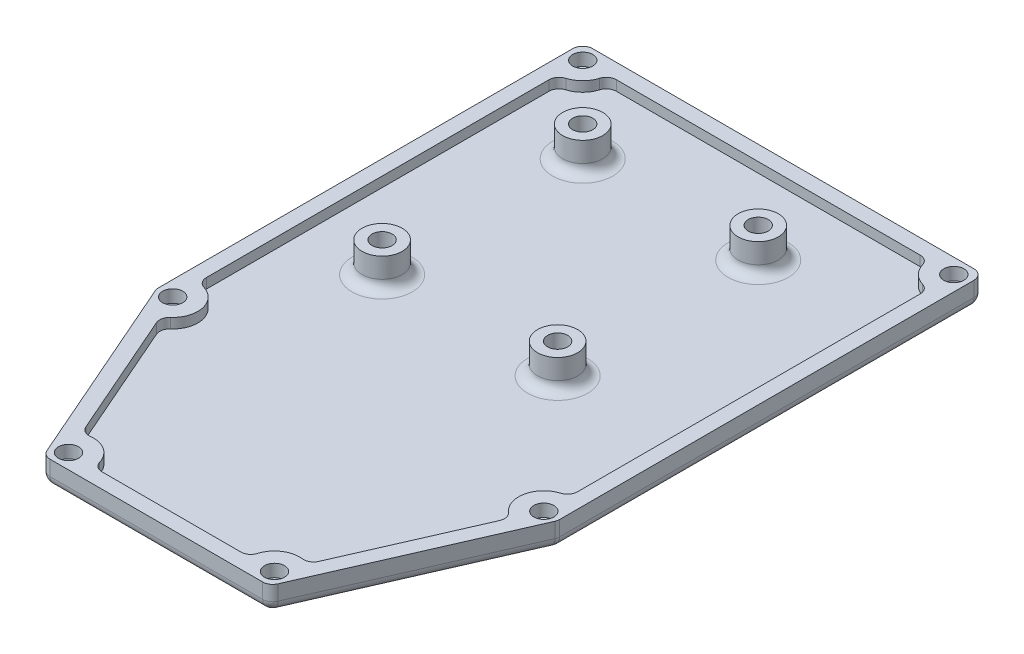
ISO-10303-21;
HEADER;
FILE_DESCRIPTION(('STEP AP214'),'2;1');
FILE_NAME('part.step','',(''),(''),'','','');
FILE_SCHEMA(('AUTOMOTIVE_DESIGN { 1 0 10303 214 1 1 1 1 }'));
ENDSEC;
DATA;
#1=APPLICATION_CONTEXT('core data for automotive mechanical design processes');
#2=APPLICATION_PROTOCOL_DEFINITION('international standard','automotive_design',2000,#1);
#3=PRODUCT_CONTEXT('',#1,'mechanical');
#4=PRODUCT('Part','Part','',(#3));
#5=PRODUCT_RELATED_PRODUCT_CATEGORY('part','',(#4));
#6=PRODUCT_DEFINITION_FORMATION('','',#4);
#7=PRODUCT_DEFINITION_CONTEXT('part definition',#1,'design');
#8=PRODUCT_DEFINITION('design','',#6,#7);
#9=PRODUCT_DEFINITION_SHAPE('','',#8);
#10=(LENGTH_UNIT() NAMED_UNIT(*) SI_UNIT(.MILLI.,.METRE.));
#11=(NAMED_UNIT(*) PLANE_ANGLE_UNIT() SI_UNIT($,.RADIAN.));
#12=(NAMED_UNIT(*) SI_UNIT($,.STERADIAN.) SOLID_ANGLE_UNIT());
#13=UNCERTAINTY_MEASURE_WITH_UNIT(LENGTH_MEASURE(1.E-05),#10,'distance_accuracy_value','');
#14=(GEOMETRIC_REPRESENTATION_CONTEXT(3) GLOBAL_UNCERTAINTY_ASSIGNED_CONTEXT((#13)) GLOBAL_UNIT_ASSIGNED_CONTEXT((#10,
#11,#12)) REPRESENTATION_CONTEXT('',''));
#15=CARTESIAN_POINT('',(0.,0.,0.));
#16=DIRECTION('',(0.,0.,1.));
#17=DIRECTION('',(1.,0.,0.));
#18=AXIS2_PLACEMENT_3D('',#15,#16,#17);
#19=CARTESIAN_POINT('',(0.,5.,0.));
#20=DIRECTION('',(0.,1.,0.));
#21=DIRECTION('',(0.,0.,1.));
#22=AXIS2_PLACEMENT_3D('',#19,#20,#21);
#23=PLANE('',#22);
#24=CARTESIAN_POINT('',(-42.96875,5.,-37.03125));
#25=DIRECTION('',(0.,1.,0.));
#26=DIRECTION('',(0.,0.,1.));
#27=AXIS2_PLACEMENT_3D('',#24,#25,#26);
#28=CIRCLE('',#27,2.);
#29=CARTESIAN_POINT('',(-42.96875,5.,-35.03125));
#30=VERTEX_POINT('',#29);
#31=EDGE_CURVE('E654',#30,#30,#28,.T.);
#32=ORIENTED_EDGE('',*,*,#31,.F.);
#33=EDGE_LOOP('',(#32));
#34=FACE_BOUND('',#33,.T.);
#35=CARTESIAN_POINT('',(31.03125,5.,-37.03125));
#36=DIRECTION('',(0.,1.,0.));
#37=DIRECTION('',(0.,0.,1.));
#38=AXIS2_PLACEMENT_3D('',#35,#36,#37);
#39=CIRCLE('',#38,2.);
#40=CARTESIAN_POINT('',(31.03125,5.,-35.03125));
#41=VERTEX_POINT('',#40);
#42=EDGE_CURVE('E658',#41,#41,#39,.T.);
#43=ORIENTED_EDGE('',*,*,#42,.F.);
#44=EDGE_LOOP('',(#43));
#45=FACE_BOUND('',#44,.T.);
#46=CARTESIAN_POINT('',(31.03125,5.,44.71875));
#47=DIRECTION('',(0.,1.,0.));
#48=DIRECTION('',(0.,0.,1.));
#49=AXIS2_PLACEMENT_3D('',#46,#47,#48);
#50=CIRCLE('',#49,2.);
#51=CARTESIAN_POINT('',(31.03125,5.,46.71875));
#52=VERTEX_POINT('',#51);
#53=EDGE_CURVE('E662',#52,#52,#50,.T.);
#54=ORIENTED_EDGE('',*,*,#53,.F.);
#55=EDGE_LOOP('',(#54));
#56=FACE_BOUND('',#55,.T.);
#57=CARTESIAN_POINT('',(14.5732967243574,5.,81.96875));
#58=DIRECTION('',(0.,1.,0.));
#59=DIRECTION('',(0.,0.,1.));
#60=AXIS2_PLACEMENT_3D('',#57,#58,#59);
#61=CIRCLE('',#60,2.);
#62=CARTESIAN_POINT('',(14.5732967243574,5.,83.96875));
#63=VERTEX_POINT('',#62);
#64=EDGE_CURVE('E666',#63,#63,#61,.T.);
#65=ORIENTED_EDGE('',*,*,#64,.F.);
#66=EDGE_LOOP('',(#65));
#67=FACE_BOUND('',#66,.T.);
#68=CARTESIAN_POINT('',(-26.5067032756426,5.,81.96875));
#69=DIRECTION('',(0.,1.,0.));
#70=DIRECTION('',(0.,0.,1.));
#71=AXIS2_PLACEMENT_3D('',#68,#69,#70);
#72=CIRCLE('',#71,2.);
#73=CARTESIAN_POINT('',(-26.5067032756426,5.,83.96875));
#74=VERTEX_POINT('',#73);
#75=EDGE_CURVE('E670',#74,#74,#72,.T.);
#76=ORIENTED_EDGE('',*,*,#75,.F.);
#77=EDGE_LOOP('',(#76));
#78=FACE_BOUND('',#77,.T.);
#79=CARTESIAN_POINT('',(-42.96875,5.,44.71875));
#80=DIRECTION('',(0.,1.,0.));
#81=DIRECTION('',(0.,0.,1.));
#82=AXIS2_PLACEMENT_3D('',#79,#80,#81);
#83=CIRCLE('',#82,2.);
#84=CARTESIAN_POINT('',(-42.96875,5.,46.71875));
#85=VERTEX_POINT('',#84);
#86=EDGE_CURVE('E674',#85,#85,#83,.T.);
#87=ORIENTED_EDGE('',*,*,#86,.F.);
#88=EDGE_LOOP('',(#87));
#89=FACE_BOUND('',#88,.T.);
#90=DIRECTION('',(1.,0.,0.));
#91=VECTOR('',#90,1.);
#92=CARTESIAN_POINT('',(-28.46875,5.,84.96875));
#93=LINE('',#92,#91);
#94=CARTESIAN_POINT('',(-27.1607188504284,5.,84.96875));
#95=VERTEX_POINT('',#94);
#96=CARTESIAN_POINT('',(15.2232188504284,5.,84.96875));
#97=VERTEX_POINT('',#96);
#98=EDGE_CURVE('E677',#95,#97,#93,.T.);
#99=ORIENTED_EDGE('',*,*,#98,.T.);
#100=CARTESIAN_POINT('',(15.2232188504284,5.,82.96875));
#101=DIRECTION('',(0.,1.,0.));
#102=DIRECTION('',(0.,0.,1.));
#103=AXIS2_PLACEMENT_3D('',#100,#101,#102);
#104=CIRCLE('',#103,2.);
#105=CARTESIAN_POINT('',(17.0555335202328,5.,83.7703876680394));
#106=VERTEX_POINT('',#105);
#107=EDGE_CURVE('E2112',#97,#106,#104,.T.);
#108=ORIENTED_EDGE('',*,*,#107,.T.);
#109=DIRECTION('',(0.400818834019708,0.,-0.916157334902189));
#110=VECTOR('',#109,1.);
#111=CARTESIAN_POINT('',(16.53125,5.,84.96875));
#112=LINE('',#111,#110);
#113=CARTESIAN_POINT('',(33.8635646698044,5.,45.3520307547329));
#114=VERTEX_POINT('',#113);
#115=EDGE_CURVE('E855',#106,#114,#112,.T.);
#116=ORIENTED_EDGE('',*,*,#115,.T.);
#117=CARTESIAN_POINT('',(32.03125,5.,44.5503930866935));
#118=DIRECTION('',(0.,1.,0.));
#119=DIRECTION('',(0.,0.,1.));
#120=AXIS2_PLACEMENT_3D('',#117,#118,#119);
#121=CIRCLE('',#120,2.);
#122=CARTESIAN_POINT('',(34.03125,5.,44.5503930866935));
#123=VERTEX_POINT('',#122);
#124=EDGE_CURVE('E2115',#114,#123,#121,.T.);
#125=ORIENTED_EDGE('',*,*,#124,.T.);
#126=DIRECTION('',(0.,0.,-1.));
#127=VECTOR('',#126,1.);
#128=CARTESIAN_POINT('',(34.03125,5.,-40.03125));
#129=LINE('',#128,#127);
#130=CARTESIAN_POINT('',(34.03125,5.,-38.03125));
#131=VERTEX_POINT('',#130);
#132=EDGE_CURVE('E859',#123,#131,#129,.T.);
#133=ORIENTED_EDGE('',*,*,#132,.T.);
#134=CARTESIAN_POINT('',(32.03125,5.,-38.03125));
#135=DIRECTION('',(0.,1.,0.));
#136=DIRECTION('',(0.,0.,1.));
#137=AXIS2_PLACEMENT_3D('',#134,#135,#136);
#138=CIRCLE('',#137,2.);
#139=CARTESIAN_POINT('',(32.03125,5.,-40.03125));
#140=VERTEX_POINT('',#139);
#141=EDGE_CURVE('E2118',#131,#140,#138,.T.);
#142=ORIENTED_EDGE('',*,*,#141,.T.);
#143=DIRECTION('',(-1.,0.,0.));
#144=VECTOR('',#143,1.);
#145=CARTESIAN_POINT('',(-45.96875,5.,-40.03125));
#146=LINE('',#145,#144);
#147=CARTESIAN_POINT('',(-43.96875,5.,-40.03125));
#148=VERTEX_POINT('',#147);
#149=EDGE_CURVE('E863',#140,#148,#146,.T.);
#150=ORIENTED_EDGE('',*,*,#149,.T.);
#151=CARTESIAN_POINT('',(-43.96875,5.,-38.03125));
#152=DIRECTION('',(0.,1.,0.));
#153=DIRECTION('',(0.,0.,1.));
#154=AXIS2_PLACEMENT_3D('',#151,#152,#153);
#155=CIRCLE('',#154,2.);
#156=CARTESIAN_POINT('',(-45.96875,5.,-38.03125));
#157=VERTEX_POINT('',#156);
#158=EDGE_CURVE('E2121',#148,#157,#155,.T.);
#159=ORIENTED_EDGE('',*,*,#158,.T.);
#160=DIRECTION('',(0.,0.,1.));
#161=VECTOR('',#160,1.);
#162=CARTESIAN_POINT('',(-45.96875,5.,-40.03125));
#163=LINE('',#162,#161);
#164=CARTESIAN_POINT('',(-45.96875,5.,44.5503930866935));
#165=VERTEX_POINT('',#164);
#166=EDGE_CURVE('E392',#157,#165,#163,.T.);
#167=ORIENTED_EDGE('',*,*,#166,.T.);
#168=CARTESIAN_POINT('',(-43.96875,5.,44.5503930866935));
#169=DIRECTION('',(0.,1.,0.));
#170=DIRECTION('',(0.,0.,1.));
#171=AXIS2_PLACEMENT_3D('',#168,#169,#170);
#172=CIRCLE('',#171,2.);
#173=CARTESIAN_POINT('',(-45.8010646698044,5.,45.3520307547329));
#174=VERTEX_POINT('',#173);
#175=EDGE_CURVE('E2127',#165,#174,#172,.T.);
#176=ORIENTED_EDGE('',*,*,#175,.T.);
#177=DIRECTION('',(0.400818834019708,0.,0.916157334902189));
#178=VECTOR('',#177,1.);
#179=CARTESIAN_POINT('',(-28.46875,5.,84.96875));
#180=LINE('',#179,#178);
#181=CARTESIAN_POINT('',(-28.9930335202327,5.,83.7703876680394));
#182=VERTEX_POINT('',#181);
#183=EDGE_CURVE('E849',#174,#182,#180,.T.);
#184=ORIENTED_EDGE('',*,*,#183,.T.);
#185=CARTESIAN_POINT('',(-27.1607188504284,5.,82.96875));
#186=DIRECTION('',(0.,1.,0.));
#187=DIRECTION('',(0.,0.,1.));
#188=AXIS2_PLACEMENT_3D('',#185,#186,#187);
#189=CIRCLE('',#188,2.);
#190=EDGE_CURVE('E2124',#182,#95,#189,.T.);
#191=ORIENTED_EDGE('',*,*,#190,.T.);
#192=EDGE_LOOP('',(#99,#108,#116,#125,#133,#142,#150,#159,#167,#176,#184,#191));
#193=FACE_BOUND('',#192,.T.);
#194=DIRECTION('',(0.400818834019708,0.,0.916157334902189));
#195=VECTOR('',#194,1.);
#196=CARTESIAN_POINT('',(-25.7202779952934,5.,83.7662934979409));
#197=LINE('',#196,#195);
#198=CARTESIAN_POINT('',(-40.1601729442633,5.,50.760819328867));
#199=VERTEX_POINT('',#198);
#200=CARTESIAN_POINT('',(-29.1954777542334,5.,75.822979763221));
#201=VERTEX_POINT('',#200);
#202=EDGE_CURVE('E681',#199,#201,#197,.T.);
#203=ORIENTED_EDGE('',*,*,#202,.F.);
#204=CARTESIAN_POINT('',(-38.3278582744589,5.,49.9591816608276));
#205=DIRECTION('',(0.,1.,0.));
#206=DIRECTION('',(0.,0.,1.));
#207=AXIS2_PLACEMENT_3D('',#204,#205,#206);
#208=CIRCLE('',#207,2.);
#209=CARTESIAN_POINT('',(-39.6538273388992,5.,48.4619154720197));
#210=VERTEX_POINT('',#209);
#211=EDGE_CURVE('E682',#199,#210,#208,.F.);
#212=ORIENTED_EDGE('',*,*,#211,.T.);
#213=CARTESIAN_POINT('',(-42.96875,5.,44.71875));
#214=DIRECTION('',(0.,1.,0.));
#215=DIRECTION('',(0.,0.,1.));
#216=AXIS2_PLACEMENT_3D('',#213,#214,#215);
#217=CIRCLE('',#216,5.);
#218=CARTESIAN_POINT('',(-41.5401785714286,5.,39.9271757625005));
#219=VERTEX_POINT('',#218);
#220=EDGE_CURVE('E700',#210,#219,#217,.T.);
#221=ORIENTED_EDGE('',*,*,#220,.T.);
#222=CARTESIAN_POINT('',(-40.96875,5.,38.0105460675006));
#223=DIRECTION('',(0.,1.,0.));
#224=DIRECTION('',(0.,0.,1.));
#225=AXIS2_PLACEMENT_3D('',#222,#223,#224);
#226=CIRCLE('',#225,2.);
#227=CARTESIAN_POINT('',(-42.96875,5.,38.0105460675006));
#228=VERTEX_POINT('',#227);
#229=EDGE_CURVE('E60',#219,#228,#226,.F.);
#230=ORIENTED_EDGE('',*,*,#229,.T.);
#231=DIRECTION('',(0.,0.,1.));
#232=VECTOR('',#231,1.);
#233=CARTESIAN_POINT('',(-42.96875,5.,-40.03125));
#234=LINE('',#233,#232);
#235=CARTESIAN_POINT('',(-42.96875,5.,-30.3230460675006));
#236=VERTEX_POINT('',#235);
#237=EDGE_CURVE('E693',#236,#228,#234,.T.);
#238=ORIENTED_EDGE('',*,*,#237,.F.);
#239=CARTESIAN_POINT('',(-40.96875,5.,-30.3230460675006));
#240=DIRECTION('',(0.,1.,0.));
#241=DIRECTION('',(0.,0.,1.));
#242=AXIS2_PLACEMENT_3D('',#239,#240,#241);
#243=CIRCLE('',#242,2.);
#244=CARTESIAN_POINT('',(-41.5401785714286,5.,-32.2396757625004));
#245=VERTEX_POINT('',#244);
#246=EDGE_CURVE('E68',#236,#245,#243,.F.);
#247=ORIENTED_EDGE('',*,*,#246,.T.);
#248=CARTESIAN_POINT('',(-42.96875,5.,-37.03125));
#249=DIRECTION('',(0.,1.,0.));
#250=DIRECTION('',(0.,0.,1.));
#251=AXIS2_PLACEMENT_3D('',#248,#249,#250);
#252=CIRCLE('',#251,5.);
#253=CARTESIAN_POINT('',(-38.1771757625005,5.,-35.6026785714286));
#254=VERTEX_POINT('',#253);
#255=EDGE_CURVE('E733',#245,#254,#252,.T.);
#256=ORIENTED_EDGE('',*,*,#255,.T.);
#257=CARTESIAN_POINT('',(-36.2605460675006,5.,-35.03125));
#258=DIRECTION('',(0.,1.,0.));
#259=DIRECTION('',(0.,0.,1.));
#260=AXIS2_PLACEMENT_3D('',#257,#258,#259);
#261=CIRCLE('',#260,2.);
#262=CARTESIAN_POINT('',(-36.2605460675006,5.,-37.03125));
#263=VERTEX_POINT('',#262);
#264=EDGE_CURVE('E1969',#254,#263,#261,.F.);
#265=ORIENTED_EDGE('',*,*,#264,.T.);
#266=DIRECTION('',(-1.,0.,0.));
#267=VECTOR('',#266,1.);
#268=CARTESIAN_POINT('',(-45.96875,5.,-37.03125));
#269=LINE('',#268,#267);
#270=CARTESIAN_POINT('',(24.3230460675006,5.,-37.03125));
#271=VERTEX_POINT('',#270);
#272=EDGE_CURVE('E711',#271,#263,#269,.T.);
#273=ORIENTED_EDGE('',*,*,#272,.F.);
#274=CARTESIAN_POINT('',(24.3230460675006,5.,-35.03125));
#275=DIRECTION('',(0.,1.,0.));
#276=DIRECTION('',(0.,0.,1.));
#277=AXIS2_PLACEMENT_3D('',#274,#275,#276);
#278=CIRCLE('',#277,2.);
#279=CARTESIAN_POINT('',(26.2396757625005,5.,-35.6026785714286));
#280=VERTEX_POINT('',#279);
#281=EDGE_CURVE('E1972',#271,#280,#278,.F.);
#282=ORIENTED_EDGE('',*,*,#281,.T.);
#283=CARTESIAN_POINT('',(31.03125,5.,-37.03125));
#284=DIRECTION('',(0.,1.,0.));
#285=DIRECTION('',(0.,0.,1.));
#286=AXIS2_PLACEMENT_3D('',#283,#284,#285);
#287=CIRCLE('',#286,5.);
#288=CARTESIAN_POINT('',(29.6026785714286,5.,-32.2396757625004));
#289=VERTEX_POINT('',#288);
#290=EDGE_CURVE('E729',#280,#289,#287,.T.);
#291=ORIENTED_EDGE('',*,*,#290,.T.);
#292=CARTESIAN_POINT('',(29.03125,5.,-30.3230460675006));
#293=DIRECTION('',(0.,1.,0.));
#294=DIRECTION('',(0.,0.,1.));
#295=AXIS2_PLACEMENT_3D('',#292,#293,#294);
#296=CIRCLE('',#295,2.);
#297=CARTESIAN_POINT('',(31.03125,5.,-30.3230460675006));
#298=VERTEX_POINT('',#297);
#299=EDGE_CURVE('E1949',#289,#298,#296,.F.);
#300=ORIENTED_EDGE('',*,*,#299,.T.);
#301=DIRECTION('',(0.,0.,-1.));
#302=VECTOR('',#301,1.);
#303=CARTESIAN_POINT('',(31.03125,5.,-40.03125));
#304=LINE('',#303,#302);
#305=CARTESIAN_POINT('',(31.03125,5.,38.0105460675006));
#306=VERTEX_POINT('',#305);
#307=EDGE_CURVE('E707',#306,#298,#304,.T.);
#308=ORIENTED_EDGE('',*,*,#307,.F.);
#309=CARTESIAN_POINT('',(29.03125,5.,38.0105460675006));
#310=DIRECTION('',(0.,1.,0.));
#311=DIRECTION('',(0.,0.,1.));
#312=AXIS2_PLACEMENT_3D('',#309,#310,#311);
#313=CIRCLE('',#312,2.);
#314=CARTESIAN_POINT('',(29.6026785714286,5.,39.9271757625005));
#315=VERTEX_POINT('',#314);
#316=EDGE_CURVE('E1955',#306,#315,#313,.F.);
#317=ORIENTED_EDGE('',*,*,#316,.T.);
#318=CARTESIAN_POINT('',(31.03125,5.,44.71875));
#319=DIRECTION('',(0.,1.,0.));
#320=DIRECTION('',(0.,0.,1.));
#321=AXIS2_PLACEMENT_3D('',#318,#319,#320);
#322=CIRCLE('',#321,5.);
#323=CARTESIAN_POINT('',(27.7163273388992,5.,48.4619154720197));
#324=VERTEX_POINT('',#323);
#325=EDGE_CURVE('E725',#315,#324,#322,.T.);
#326=ORIENTED_EDGE('',*,*,#325,.T.);
#327=CARTESIAN_POINT('',(26.3903582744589,5.,49.9591816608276));
#328=DIRECTION('',(0.,1.,0.));
#329=DIRECTION('',(0.,0.,1.));
#330=AXIS2_PLACEMENT_3D('',#327,#328,#329);
#331=CIRCLE('',#330,2.);
#332=CARTESIAN_POINT('',(28.2226729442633,5.,50.760819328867));
#333=VERTEX_POINT('',#332);
#334=EDGE_CURVE('E1952',#324,#333,#331,.F.);
#335=ORIENTED_EDGE('',*,*,#334,.T.);
#336=DIRECTION('',(0.400818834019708,0.,-0.916157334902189));
#337=VECTOR('',#336,1.);
#338=CARTESIAN_POINT('',(13.7827779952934,5.,83.7662934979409));
#339=LINE('',#338,#337);
#340=CARTESIAN_POINT('',(17.2581867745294,5.,75.8225020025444));
#341=VERTEX_POINT('',#340);
#342=EDGE_CURVE('E698',#341,#333,#339,.T.);
#343=ORIENTED_EDGE('',*,*,#342,.F.);
#344=CARTESIAN_POINT('',(15.425872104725,5.,75.020864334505));
#345=DIRECTION('',(0.,1.,0.));
#346=DIRECTION('',(0.,0.,1.));
#347=AXIS2_PLACEMENT_3D('',#344,#345,#346);
#348=CIRCLE('',#347,2.);
#349=CARTESIAN_POINT('',(15.1822791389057,5.,77.0059745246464));
#350=VERTEX_POINT('',#349);
#351=EDGE_CURVE('E1958',#341,#350,#348,.F.);
#352=ORIENTED_EDGE('',*,*,#351,.T.);
#353=CARTESIAN_POINT('',(14.5732967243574,5.,81.96875));
#354=DIRECTION('',(0.,1.,0.));
#355=DIRECTION('',(0.,0.,1.));
#356=AXIS2_PLACEMENT_3D('',#353,#354,#355);
#357=CIRCLE('',#356,5.);
#358=CARTESIAN_POINT('',(9.7817224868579,5.,80.5401785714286));
#359=VERTEX_POINT('',#358);
#360=EDGE_CURVE('E721',#350,#359,#357,.T.);
#361=ORIENTED_EDGE('',*,*,#360,.T.);
#362=CARTESIAN_POINT('',(7.86509279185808,5.,79.96875));
#363=DIRECTION('',(0.,1.,0.));
#364=DIRECTION('',(0.,0.,1.));
#365=AXIS2_PLACEMENT_3D('',#362,#363,#364);
#366=CIRCLE('',#365,2.);
#367=CARTESIAN_POINT('',(7.86509279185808,5.,81.96875));
#368=VERTEX_POINT('',#367);
#369=EDGE_CURVE('E1961',#359,#368,#366,.F.);
#370=ORIENTED_EDGE('',*,*,#369,.T.);
#371=DIRECTION('',(1.,0.,0.));
#372=VECTOR('',#371,1.);
#373=CARTESIAN_POINT('',(-28.46875,5.,81.96875));
#374=LINE('',#373,#372);
#375=CARTESIAN_POINT('',(-19.7984993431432,5.,81.96875));
#376=VERTEX_POINT('',#375);
#377=EDGE_CURVE('E692',#376,#368,#374,.T.);
#378=ORIENTED_EDGE('',*,*,#377,.F.);
#379=CARTESIAN_POINT('',(-19.7984993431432,5.,79.96875));
#380=DIRECTION('',(0.,1.,0.));
#381=DIRECTION('',(0.,0.,1.));
#382=AXIS2_PLACEMENT_3D('',#379,#380,#381);
#383=CIRCLE('',#382,2.);
#384=CARTESIAN_POINT('',(-21.715129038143,5.,80.5401785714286));
#385=VERTEX_POINT('',#384);
#386=EDGE_CURVE('E1966',#376,#385,#383,.F.);
#387=ORIENTED_EDGE('',*,*,#386,.T.);
#388=CARTESIAN_POINT('',(-26.5067032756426,5.,81.96875));
#389=DIRECTION('',(0.,1.,0.));
#390=DIRECTION('',(0.,0.,1.));
#391=AXIS2_PLACEMENT_3D('',#388,#389,#390);
#392=CIRCLE('',#391,5.);
#393=CARTESIAN_POINT('',(-27.1184602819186,5.,77.0063157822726));
#394=VERTEX_POINT('',#393);
#395=EDGE_CURVE('E718',#385,#394,#392,.T.);
#396=ORIENTED_EDGE('',*,*,#395,.T.);
#397=CARTESIAN_POINT('',(-27.363163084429,5.,75.0213420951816));
#398=DIRECTION('',(0.,1.,0.));
#399=DIRECTION('',(0.,0.,1.));
#400=AXIS2_PLACEMENT_3D('',#397,#398,#399);
#401=CIRCLE('',#400,2.);
#402=EDGE_CURVE('E686',#394,#201,#401,.F.);
#403=ORIENTED_EDGE('',*,*,#402,.T.);
#404=EDGE_LOOP('',(#203,#212,#221,#230,#238,#247,#256,#265,#273,#282,#291,#300,#308,#317,#326,
#335,#343,#352,#361,#370,#378,#387,#396,#403));
#405=FACE_BOUND('',#404,.T.);
#406=ADVANCED_FACE('F44',(#34,#45,#56,#67,#78,#89,#193,#405),#23,.T.);
#407=CARTESIAN_POINT('',(0.,0.,0.));
#408=DIRECTION('',(0.,1.,0.));
#409=DIRECTION('',(0.,0.,1.));
#410=AXIS2_PLACEMENT_3D('',#407,#408,#409);
#411=PLANE('',#410);
#412=CARTESIAN_POINT('',(-42.96875,0.,44.71875));
#413=DIRECTION('',(0.,1.,0.));
#414=DIRECTION('',(0.,0.,1.));
#415=AXIS2_PLACEMENT_3D('',#412,#413,#414);
#416=CIRCLE('',#415,1.1);
#417=CARTESIAN_POINT('',(-43.4657704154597,0.,45.7000607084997));
#418=VERTEX_POINT('',#417);
#419=CARTESIAN_POINT('',(-43.96875,0.,44.2604924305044));
#420=VERTEX_POINT('',#419);
#421=EDGE_CURVE('E370',#418,#420,#416,.T.);
#422=ORIENTED_EDGE('',*,*,#421,.T.);
#423=DIRECTION('',(0.,0.,1.));
#424=VECTOR('',#423,1.);
#425=CARTESIAN_POINT('',(-43.96875,0.,0.));
#426=LINE('',#425,#424);
#427=CARTESIAN_POINT('',(-43.96875,0.,-36.5729924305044));
#428=VERTEX_POINT('',#427);
#429=EDGE_CURVE('E386',#420,#428,#426,.F.);
#430=ORIENTED_EDGE('',*,*,#429,.T.);
#431=CARTESIAN_POINT('',(-42.96875,0.,-37.03125));
#432=DIRECTION('',(0.,1.,0.));
#433=DIRECTION('',(0.,0.,1.));
#434=AXIS2_PLACEMENT_3D('',#431,#432,#433);
#435=CIRCLE('',#434,1.1);
#436=CARTESIAN_POINT('',(-42.5104924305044,0.,-38.03125));
#437=VERTEX_POINT('',#436);
#438=EDGE_CURVE('E775',#428,#437,#435,.T.);
#439=ORIENTED_EDGE('',*,*,#438,.T.);
#440=DIRECTION('',(-1.,0.,0.));
#441=VECTOR('',#440,1.);
#442=CARTESIAN_POINT('',(0.,0.,-38.03125));
#443=LINE('',#442,#441);
#444=CARTESIAN_POINT('',(30.5729924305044,0.,-38.03125));
#445=VERTEX_POINT('',#444);
#446=EDGE_CURVE('E925',#437,#445,#443,.F.);
#447=ORIENTED_EDGE('',*,*,#446,.T.);
#448=CARTESIAN_POINT('',(31.03125,0.,-37.03125));
#449=DIRECTION('',(0.,1.,0.));
#450=DIRECTION('',(0.,0.,1.));
#451=AXIS2_PLACEMENT_3D('',#448,#449,#450);
#452=CIRCLE('',#451,1.1);
#453=CARTESIAN_POINT('',(32.03125,0.,-36.5729924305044));
#454=VERTEX_POINT('',#453);
#455=EDGE_CURVE('E789',#445,#454,#452,.T.);
#456=ORIENTED_EDGE('',*,*,#455,.T.);
#457=DIRECTION('',(0.,0.,-1.));
#458=VECTOR('',#457,1.);
#459=CARTESIAN_POINT('',(32.03125,0.,0.));
#460=LINE('',#459,#458);
#461=CARTESIAN_POINT('',(32.03125,0.,44.2604924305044));
#462=VERTEX_POINT('',#461);
#463=EDGE_CURVE('E919',#454,#462,#460,.F.);
#464=ORIENTED_EDGE('',*,*,#463,.T.);
#465=CARTESIAN_POINT('',(31.03125,0.,44.71875));
#466=DIRECTION('',(0.,1.,0.));
#467=DIRECTION('',(0.,0.,1.));
#468=AXIS2_PLACEMENT_3D('',#465,#466,#467);
#469=CIRCLE('',#468,1.1);
#470=CARTESIAN_POINT('',(31.5282704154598,0.,45.7000607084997));
#471=VERTEX_POINT('',#470);
#472=EDGE_CURVE('E804',#462,#471,#469,.T.);
#473=ORIENTED_EDGE('',*,*,#472,.T.);
#474=DIRECTION('',(0.400818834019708,0.,-0.916157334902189));
#475=VECTOR('',#474,1.);
#476=CARTESIAN_POINT('',(43.2447345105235,0.,18.919571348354));
#477=LINE('',#476,#475);
#478=CARTESIAN_POINT('',(15.6729418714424,0.,81.9408116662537));
#479=VERTEX_POINT('',#478);
#480=EDGE_CURVE('E935',#471,#479,#477,.F.);
#481=ORIENTED_EDGE('',*,*,#480,.T.);
#482=CARTESIAN_POINT('',(14.5732967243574,0.,81.96875));
#483=DIRECTION('',(0.,1.,0.));
#484=DIRECTION('',(0.,0.,1.));
#485=AXIS2_PLACEMENT_3D('',#482,#483,#484);
#486=CIRCLE('',#485,1.1);
#487=CARTESIAN_POINT('',(14.1150391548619,0.,82.96875));
#488=VERTEX_POINT('',#487);
#489=EDGE_CURVE('E818',#479,#488,#486,.T.);
#490=ORIENTED_EDGE('',*,*,#489,.T.);
#491=DIRECTION('',(1.,0.,0.));
#492=VECTOR('',#491,1.);
#493=CARTESIAN_POINT('',(0.,0.,82.96875));
#494=LINE('',#493,#492);
#495=CARTESIAN_POINT('',(-26.048445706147,0.,82.96875));
#496=VERTEX_POINT('',#495);
#497=EDGE_CURVE('E405',#488,#496,#494,.F.);
#498=ORIENTED_EDGE('',*,*,#497,.T.);
#499=CARTESIAN_POINT('',(-26.5067032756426,0.,81.96875));
#500=DIRECTION('',(0.,1.,0.));
#501=DIRECTION('',(0.,0.,1.));
#502=AXIS2_PLACEMENT_3D('',#499,#500,#501);
#503=CIRCLE('',#502,1.1);
#504=CARTESIAN_POINT('',(-27.6065388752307,0.,81.9497328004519));
#505=VERTEX_POINT('',#504);
#506=EDGE_CURVE('E834',#496,#505,#503,.T.);
#507=ORIENTED_EDGE('',*,*,#506,.T.);
#508=DIRECTION('',(0.400818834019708,0.,0.916157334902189));
#509=VECTOR('',#508,1.);
#510=CARTESIAN_POINT('',(-53.264406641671,0.,23.3031779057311));
#511=LINE('',#510,#509);
#512=EDGE_CURVE('E390',#505,#418,#511,.F.);
#513=ORIENTED_EDGE('',*,*,#512,.T.);
#514=EDGE_LOOP('',(#422,#430,#439,#447,#456,#464,#473,#481,#490,#498,#507,#513));
#515=FACE_BOUND('',#514,.T.);
#516=ADVANCED_FACE('F384',(#515),#411,.F.);
#517=DIRECTION('',(1.,0.,0.));
#518=VECTOR('',#517,1.);
#519=CARTESIAN_POINT('',(0.,0.,82.96875));
#520=LINE('',#519,#518);
#521=CARTESIAN_POINT('',(-26.9649608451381,0.,82.96875));
#522=VERTEX_POINT('',#521);
#523=CARTESIAN_POINT('',(-27.1607188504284,0.,82.96875));
#524=VERTEX_POINT('',#523);
#525=EDGE_CURVE('E938',#522,#524,#520,.F.);
#526=ORIENTED_EDGE('',*,*,#525,.T.);
#527=DIRECTION('',(0.400818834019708,0.,0.916157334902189));
#528=VECTOR('',#527,1.);
#529=CARTESIAN_POINT('',(-53.264406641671,0.,23.3031779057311));
#530=LINE('',#529,#528);
#531=CARTESIAN_POINT('',(-27.2391823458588,0.,82.7894048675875));
#532=VERTEX_POINT('',#531);
#533=EDGE_CURVE('E894',#524,#532,#530,.F.);
#534=ORIENTED_EDGE('',*,*,#533,.T.);
#535=EDGE_CURVE('E833',#532,#522,#503,.T.);
#536=ORIENTED_EDGE('',*,*,#535,.T.);
#537=EDGE_LOOP('',(#526,#534,#536));
#538=FACE_BOUND('',#537,.T.);
#539=ADVANCED_FACE('F650',(#538),#411,.F.);
#540=DIRECTION('',(0.400818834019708,0.,-0.916157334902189));
#541=VECTOR('',#540,1.);
#542=CARTESIAN_POINT('',(43.2447345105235,0.,18.919571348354));
#543=LINE('',#542,#541);
#544=CARTESIAN_POINT('',(15.2990946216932,0.,82.7953196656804));
#545=VERTEX_POINT('',#544);
#546=CARTESIAN_POINT('',(15.2232188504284,0.,82.96875));
#547=VERTEX_POINT('',#546);
#548=EDGE_CURVE('E923',#545,#547,#543,.F.);
#549=ORIENTED_EDGE('',*,*,#548,.T.);
#550=DIRECTION('',(1.,0.,0.));
#551=VECTOR('',#550,1.);
#552=CARTESIAN_POINT('',(0.,0.,82.96875));
#553=LINE('',#552,#551);
#554=CARTESIAN_POINT('',(15.031554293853,0.,82.96875));
#555=VERTEX_POINT('',#554);
#556=EDGE_CURVE('E932',#547,#555,#553,.F.);
#557=ORIENTED_EDGE('',*,*,#556,.T.);
#558=EDGE_CURVE('E819',#555,#545,#486,.T.);
#559=ORIENTED_EDGE('',*,*,#558,.T.);
#560=EDGE_LOOP('',(#549,#557,#559));
#561=FACE_BOUND('',#560,.T.);
#562=ADVANCED_FACE('F1267',(#561),#411,.F.);
#563=CARTESIAN_POINT('',(-43.4270075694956,0.,-38.03125));
#564=VERTEX_POINT('',#563);
#565=CARTESIAN_POINT('',(-43.96875,0.,-37.4895075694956));
#566=VERTEX_POINT('',#565);
#567=EDGE_CURVE('E778',#564,#566,#435,.T.);
#568=ORIENTED_EDGE('',*,*,#567,.T.);
#569=DIRECTION('',(0.,0.,1.));
#570=VECTOR('',#569,1.);
#571=CARTESIAN_POINT('',(-43.96875,0.,0.));
#572=LINE('',#571,#570);
#573=CARTESIAN_POINT('',(-43.96875,0.,-38.03125));
#574=VERTEX_POINT('',#573);
#575=EDGE_CURVE('E913',#566,#574,#572,.F.);
#576=ORIENTED_EDGE('',*,*,#575,.T.);
#577=DIRECTION('',(-1.,0.,0.));
#578=VECTOR('',#577,1.);
#579=CARTESIAN_POINT('',(0.,0.,-38.03125));
#580=LINE('',#579,#578);
#581=EDGE_CURVE('E915',#574,#564,#580,.F.);
#582=ORIENTED_EDGE('',*,*,#581,.T.);
#583=EDGE_LOOP('',(#568,#576,#582));
#584=FACE_BOUND('',#583,.T.);
#585=ADVANCED_FACE('F912',(#584),#411,.F.);
#586=CARTESIAN_POINT('',(-45.96875,5.,-40.03125));
#587=DIRECTION('',(1.,0.,0.));
#588=DIRECTION('',(0.,0.,-1.));
#589=AXIS2_PLACEMENT_3D('',#586,#587,#588);
#590=PLANE('',#589);
#591=ORIENTED_EDGE('',*,*,#166,.F.);
#592=DIRECTION('',(0.,-1.,0.));
#593=VECTOR('',#592,1.);
#594=CARTESIAN_POINT('',(-45.96875,5.,-38.03125));
#595=LINE('',#594,#593);
#596=CARTESIAN_POINT('',(-45.96875,2.,-38.03125));
#597=VERTEX_POINT('',#596);
#598=EDGE_CURVE('E2094',#157,#597,#595,.T.);
#599=ORIENTED_EDGE('',*,*,#598,.T.);
#600=DIRECTION('',(0.,0.,1.));
#601=VECTOR('',#600,1.);
#602=CARTESIAN_POINT('',(-45.96875,2.,-40.03125));
#603=LINE('',#602,#601);
#604=CARTESIAN_POINT('',(-45.96875,2.,44.5503930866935));
#605=VERTEX_POINT('',#604);
#606=EDGE_CURVE('E866',#597,#605,#603,.T.);
#607=ORIENTED_EDGE('',*,*,#606,.T.);
#608=DIRECTION('',(0.,-1.,0.));
#609=VECTOR('',#608,1.);
#610=CARTESIAN_POINT('',(-45.96875,5.,44.5503930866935));
#611=LINE('',#610,#609);
#612=EDGE_CURVE('E2097',#605,#165,#611,.F.);
#613=ORIENTED_EDGE('',*,*,#612,.T.);
#614=EDGE_LOOP('',(#591,#599,#607,#613));
#615=FACE_BOUND('',#614,.T.);
#616=ADVANCED_FACE('F604',(#615),#590,.F.);
#617=CARTESIAN_POINT('',(-28.46875,5.,84.96875));
#618=DIRECTION('',(0.916157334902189,0.,-0.400818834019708));
#619=DIRECTION('',(-0.400818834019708,0.,-0.916157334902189));
#620=AXIS2_PLACEMENT_3D('',#617,#618,#619);
#621=PLANE('',#620);
#622=DIRECTION('',(0.400818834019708,0.,0.916157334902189));
#623=VECTOR('',#622,1.);
#624=CARTESIAN_POINT('',(-28.46875,2.,84.96875));
#625=LINE('',#624,#623);
#626=CARTESIAN_POINT('',(-45.8010646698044,2.,45.3520307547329));
#627=VERTEX_POINT('',#626);
#628=CARTESIAN_POINT('',(-28.9930335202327,2.,83.7703876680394));
#629=VERTEX_POINT('',#628);
#630=EDGE_CURVE('E892',#627,#629,#625,.T.);
#631=ORIENTED_EDGE('',*,*,#630,.T.);
#632=DIRECTION('',(0.,-1.,0.));
#633=VECTOR('',#632,1.);
#634=CARTESIAN_POINT('',(-28.9930335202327,5.,83.7703876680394));
#635=LINE('',#634,#633);
#636=EDGE_CURVE('E900',#629,#182,#635,.F.);
#637=ORIENTED_EDGE('',*,*,#636,.T.);
#638=ORIENTED_EDGE('',*,*,#183,.F.);
#639=DIRECTION('',(0.,-1.,0.));
#640=VECTOR('',#639,1.);
#641=CARTESIAN_POINT('',(-45.8010646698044,5.,45.3520307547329));
#642=LINE('',#641,#640);
#643=EDGE_CURVE('E902',#174,#627,#642,.T.);
#644=ORIENTED_EDGE('',*,*,#643,.T.);
#645=EDGE_LOOP('',(#631,#637,#638,#644));
#646=FACE_BOUND('',#645,.T.);
#647=ADVANCED_FACE('F897',(#646),#621,.F.);
#648=CARTESIAN_POINT('',(-28.46875,5.,84.96875));
#649=DIRECTION('',(0.,0.,-1.));
#650=DIRECTION('',(-1.,0.,0.));
#651=AXIS2_PLACEMENT_3D('',#648,#649,#650);
#652=PLANE('',#651);
#653=DIRECTION('',(1.,0.,0.));
#654=VECTOR('',#653,1.);
#655=CARTESIAN_POINT('',(-28.46875,2.,84.96875));
#656=LINE('',#655,#654);
#657=CARTESIAN_POINT('',(-27.1607188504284,2.,84.96875));
#658=VERTEX_POINT('',#657);
#659=CARTESIAN_POINT('',(15.2232188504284,2.,84.96875));
#660=VERTEX_POINT('',#659);
#661=EDGE_CURVE('E621',#658,#660,#656,.T.);
#662=ORIENTED_EDGE('',*,*,#661,.T.);
#663=DIRECTION('',(0.,-1.,0.));
#664=VECTOR('',#663,1.);
#665=CARTESIAN_POINT('',(15.2232188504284,5.,84.96875));
#666=LINE('',#665,#664);
#667=EDGE_CURVE('E2130',#660,#97,#666,.F.);
#668=ORIENTED_EDGE('',*,*,#667,.T.);
#669=ORIENTED_EDGE('',*,*,#98,.F.);
#670=DIRECTION('',(0.,-1.,0.));
#671=VECTOR('',#670,1.);
#672=CARTESIAN_POINT('',(-27.1607188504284,5.,84.96875));
#673=LINE('',#672,#671);
#674=EDGE_CURVE('E2133',#95,#658,#673,.T.);
#675=ORIENTED_EDGE('',*,*,#674,.T.);
#676=EDGE_LOOP('',(#662,#668,#669,#675));
#677=FACE_BOUND('',#676,.T.);
#678=ADVANCED_FACE('F2189',(#677),#652,.F.);
#679=CARTESIAN_POINT('',(16.53125,5.,84.96875));
#680=DIRECTION('',(-0.916157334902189,0.,-0.400818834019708));
#681=DIRECTION('',(-0.400818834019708,0.,0.916157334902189));
#682=AXIS2_PLACEMENT_3D('',#679,#680,#681);
#683=PLANE('',#682);
#684=ORIENTED_EDGE('',*,*,#115,.F.);
#685=DIRECTION('',(0.,-1.,0.));
#686=VECTOR('',#685,1.);
#687=CARTESIAN_POINT('',(17.0555335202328,5.,83.7703876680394));
#688=LINE('',#687,#686);
#689=CARTESIAN_POINT('',(17.0555335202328,2.,83.7703876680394));
#690=VERTEX_POINT('',#689);
#691=EDGE_CURVE('E2135',#106,#690,#688,.T.);
#692=ORIENTED_EDGE('',*,*,#691,.T.);
#693=DIRECTION('',(0.400818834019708,0.,-0.916157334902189));
#694=VECTOR('',#693,1.);
#695=CARTESIAN_POINT('',(16.53125,2.,84.96875));
#696=LINE('',#695,#694);
#697=CARTESIAN_POINT('',(33.8635646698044,2.,45.3520307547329));
#698=VERTEX_POINT('',#697);
#699=EDGE_CURVE('E491',#690,#698,#696,.T.);
#700=ORIENTED_EDGE('',*,*,#699,.T.);
#701=DIRECTION('',(0.,-1.,0.));
#702=VECTOR('',#701,1.);
#703=CARTESIAN_POINT('',(33.8635646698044,5.,45.3520307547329));
#704=LINE('',#703,#702);
#705=EDGE_CURVE('E574',#698,#114,#704,.F.);
#706=ORIENTED_EDGE('',*,*,#705,.T.);
#707=EDGE_LOOP('',(#684,#692,#700,#706));
#708=FACE_BOUND('',#707,.T.);
#709=ADVANCED_FACE('F2144',(#708),#683,.F.);
#710=CARTESIAN_POINT('',(34.03125,5.,-40.03125));
#711=DIRECTION('',(-1.,0.,0.));
#712=DIRECTION('',(0.,0.,1.));
#713=AXIS2_PLACEMENT_3D('',#710,#711,#712);
#714=PLANE('',#713);
#715=ORIENTED_EDGE('',*,*,#132,.F.);
#716=DIRECTION('',(0.,-1.,0.));
#717=VECTOR('',#716,1.);
#718=CARTESIAN_POINT('',(34.03125,5.,44.5503930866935));
#719=LINE('',#718,#717);
#720=CARTESIAN_POINT('',(34.03125,2.,44.5503930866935));
#721=VERTEX_POINT('',#720);
#722=EDGE_CURVE('E2106',#123,#721,#719,.T.);
#723=ORIENTED_EDGE('',*,*,#722,.T.);
#724=DIRECTION('',(0.,0.,-1.));
#725=VECTOR('',#724,1.);
#726=CARTESIAN_POINT('',(34.03125,2.,-40.03125));
#727=LINE('',#726,#725);
#728=CARTESIAN_POINT('',(34.03125,2.,-38.03125));
#729=VERTEX_POINT('',#728);
#730=EDGE_CURVE('E2154',#721,#729,#727,.T.);
#731=ORIENTED_EDGE('',*,*,#730,.T.);
#732=DIRECTION('',(0.,-1.,0.));
#733=VECTOR('',#732,1.);
#734=CARTESIAN_POINT('',(34.03125,5.,-38.03125));
#735=LINE('',#734,#733);
#736=EDGE_CURVE('E2109',#729,#131,#735,.F.);
#737=ORIENTED_EDGE('',*,*,#736,.T.);
#738=EDGE_LOOP('',(#715,#723,#731,#737));
#739=FACE_BOUND('',#738,.T.);
#740=ADVANCED_FACE('F2153',(#739),#714,.F.);
#741=CARTESIAN_POINT('',(-45.96875,5.,-40.03125));
#742=DIRECTION('',(0.,0.,1.));
#743=DIRECTION('',(1.,0.,0.));
#744=AXIS2_PLACEMENT_3D('',#741,#742,#743);
#745=PLANE('',#744);
#746=ORIENTED_EDGE('',*,*,#149,.F.);
#747=DIRECTION('',(0.,-1.,0.));
#748=VECTOR('',#747,1.);
#749=CARTESIAN_POINT('',(32.03125,5.,-40.03125));
#750=LINE('',#749,#748);
#751=CARTESIAN_POINT('',(32.03125,2.,-40.03125));
#752=VERTEX_POINT('',#751);
#753=EDGE_CURVE('E2100',#140,#752,#750,.T.);
#754=ORIENTED_EDGE('',*,*,#753,.T.);
#755=DIRECTION('',(-1.,0.,0.));
#756=VECTOR('',#755,1.);
#757=CARTESIAN_POINT('',(-45.96875,2.,-40.03125));
#758=LINE('',#757,#756);
#759=CARTESIAN_POINT('',(-43.96875,2.,-40.03125));
#760=VERTEX_POINT('',#759);
#761=EDGE_CURVE('E466',#752,#760,#758,.T.);
#762=ORIENTED_EDGE('',*,*,#761,.T.);
#763=DIRECTION('',(0.,-1.,0.));
#764=VECTOR('',#763,1.);
#765=CARTESIAN_POINT('',(-43.96875,5.,-40.03125));
#766=LINE('',#765,#764);
#767=EDGE_CURVE('E2103',#760,#148,#766,.F.);
#768=ORIENTED_EDGE('',*,*,#767,.T.);
#769=EDGE_LOOP('',(#746,#754,#762,#768));
#770=FACE_BOUND('',#769,.T.);
#771=ADVANCED_FACE('F2220',(#770),#745,.F.);
#772=DIRECTION('',(-1.,0.,0.));
#773=VECTOR('',#772,1.);
#774=CARTESIAN_POINT('',(0.,0.,-38.03125));
#775=LINE('',#774,#773);
#776=CARTESIAN_POINT('',(31.4895075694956,0.,-38.03125));
#777=VERTEX_POINT('',#776);
#778=CARTESIAN_POINT('',(32.03125,0.,-38.03125));
#779=VERTEX_POINT('',#778);
#780=EDGE_CURVE('E379',#777,#779,#775,.F.);
#781=ORIENTED_EDGE('',*,*,#780,.T.);
#782=DIRECTION('',(0.,0.,-1.));
#783=VECTOR('',#782,1.);
#784=CARTESIAN_POINT('',(32.03125,0.,0.));
#785=LINE('',#784,#783);
#786=CARTESIAN_POINT('',(32.03125,0.,-37.4895075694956));
#787=VERTEX_POINT('',#786);
#788=EDGE_CURVE('E2229',#779,#787,#785,.F.);
#789=ORIENTED_EDGE('',*,*,#788,.T.);
#790=EDGE_CURVE('E793',#787,#777,#452,.T.);
#791=ORIENTED_EDGE('',*,*,#790,.T.);
#792=EDGE_LOOP('',(#781,#789,#791));
#793=FACE_BOUND('',#792,.T.);
#794=ADVANCED_FACE('F583',(#793),#411,.F.);
#795=CARTESIAN_POINT('',(-42.96875,5.,44.71875));
#796=DIRECTION('',(0.,1.,0.));
#797=DIRECTION('',(0.,0.,1.));
#798=AXIS2_PLACEMENT_3D('',#795,#796,#797);
#799=CYLINDRICAL_SURFACE('',#798,1.1);
#800=CARTESIAN_POINT('',(-43.4657704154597,0.,45.7000607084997));
#801=CARTESIAN_POINT('',(-43.4933304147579,9.76502560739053E-07,45.6861019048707));
#802=CARTESIAN_POINT('',(-43.5202865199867,0.0002895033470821,45.6709893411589));
#803=CARTESIAN_POINT('',(-43.5728244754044,0.00127097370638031,45.6385585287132));
#804=CARTESIAN_POINT('',(-43.5984065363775,0.00196385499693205,45.6212406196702));
#805=CARTESIAN_POINT('',(-43.6727943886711,0.00439129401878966,45.5661690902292));
#806=CARTESIAN_POINT('',(-43.7193093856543,0.00647547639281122,45.5252633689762));
#807=CARTESIAN_POINT('',(-43.8048205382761,0.0104055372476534,45.436246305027));
#808=CARTESIAN_POINT('',(-43.8438153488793,0.0122513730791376,45.3881336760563));
#809=CARTESIAN_POINT('',(-43.9131974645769,0.0149027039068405,45.2860445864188));
#810=CARTESIAN_POINT('',(-43.9435881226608,0.0157086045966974,45.2320704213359));
#811=CARTESIAN_POINT('',(-43.9948602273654,0.015961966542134,45.119872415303));
#812=CARTESIAN_POINT('',(-44.0157544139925,0.0154112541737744,45.0616543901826));
#813=CARTESIAN_POINT('',(-44.0475029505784,0.0131702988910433,44.9425515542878));
#814=CARTESIAN_POINT('',(-44.0583581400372,0.0114801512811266,44.8816669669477));
#815=CARTESIAN_POINT('',(-44.0679298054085,0.00828214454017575,44.7785153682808));
#816=CARTESIAN_POINT('',(-44.0694074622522,0.00688702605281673,44.7364802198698));
#817=CARTESIAN_POINT('',(-44.067559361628,0.00425071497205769,44.6525874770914));
#818=CARTESIAN_POINT('',(-44.0642423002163,0.00300924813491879,44.6107296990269));
#819=CARTESIAN_POINT('',(-44.0585329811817,0.00201626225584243,44.5691737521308));
#820=B_SPLINE_CURVE_WITH_KNOTS('',3,(#800,#801,#802,#803,#804,#805,#806,#807,#808,#809,#810,
#811,#812,#813,#814,#815,#816,#817,#818,#819),.UNSPECIFIED.,.F.,.F.,(4,2,2,2,2,2,2,2,2,4),(0.,
0.0926184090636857,0.185222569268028,0.370206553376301,0.555223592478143,0.740168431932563,
0.92486442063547,1.10954496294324,1.2355397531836,1.36130631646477),.UNSPECIFIED.);
#821=CARTESIAN_POINT('',(-44.0612926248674,0.00255247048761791,44.5908804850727));
#822=VERTEX_POINT('',#821);
#823=EDGE_CURVE('E380',#418,#822,#820,.T.);
#824=ORIENTED_EDGE('',*,*,#823,.T.);
#825=CARTESIAN_POINT('',(-44.0612926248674,0.0025524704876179,44.5908804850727));
#826=CARTESIAN_POINT('',(-44.0605009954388,0.00237869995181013,44.5841165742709));
#827=CARTESIAN_POINT('',(-44.0596466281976,0.00223701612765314,44.577360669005));
#828=CARTESIAN_POINT('',(-44.0578124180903,0.00201782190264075,44.5638648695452));
#829=CARTESIAN_POINT('',(-44.0568325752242,0.00194031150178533,44.5571249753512));
#830=CARTESIAN_POINT('',(-44.0557899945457,0.0018948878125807,44.5503930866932));
#831=B_SPLINE_CURVE_WITH_KNOTS('',3,(#825,#826,#827,#828,#829,#830),.UNSPECIFIED.,.F.,.F.,(4,2,
4),(0.,0.0204335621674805,0.0408671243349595),.UNSPECIFIED.);
#832=CARTESIAN_POINT('',(-44.0557899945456,0.00189488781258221,44.5503930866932));
#833=VERTEX_POINT('',#832);
#834=EDGE_CURVE('E373',#822,#833,#831,.T.);
#835=ORIENTED_EDGE('',*,*,#834,.T.);
#836=CARTESIAN_POINT('',(-44.0585329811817,0.00201626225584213,44.5691737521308));
#837=CARTESIAN_POINT('',(-44.0548689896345,0.0018542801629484,44.5424657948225));
#838=CARTESIAN_POINT('',(-44.0502198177,0.00165278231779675,44.5158936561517));
#839=CARTESIAN_POINT('',(-44.0390140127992,0.00122615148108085,44.4633034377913));
#840=CARTESIAN_POINT('',(-44.0324677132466,0.00100115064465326,44.4372831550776));
#841=CARTESIAN_POINT('',(-44.0174906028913,0.000580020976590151,44.3857903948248));
#842=CARTESIAN_POINT('',(-44.0090597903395,0.000383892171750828,44.3603179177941));
#843=CARTESIAN_POINT('',(-43.9903107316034,9.46339962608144E-05,44.309920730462));
#844=CARTESIAN_POINT('',(-43.9799825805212,2.06411939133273E-06,44.2849997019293));
#845=CARTESIAN_POINT('',(-43.96875,0.,44.2604924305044));
#846=B_SPLINE_CURVE_WITH_KNOTS('',3,(#836,#837,#838,#839,#840,#841,#842,#843,#844,#845),
.UNSPECIFIED.,.F.,.F.,(4,2,2,2,4),(0.,0.0808569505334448,0.1612815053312,0.241706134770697,
0.322563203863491),.UNSPECIFIED.);
#847=EDGE_CURVE('E365',#833,#420,#846,.T.);
#848=ORIENTED_EDGE('',*,*,#847,.T.);
#849=ORIENTED_EDGE('',*,*,#421,.F.);
#850=EDGE_LOOP('',(#824,#835,#848,#849));
#851=FACE_BOUND('',#850,.T.);
#852=CARTESIAN_POINT('',(-42.96875,2.5,44.71875));
#853=DIRECTION('',(0.,1.,0.));
#854=DIRECTION('',(0.,0.,1.));
#855=AXIS2_PLACEMENT_3D('',#852,#853,#854);
#856=CIRCLE('',#855,1.1);
#857=CARTESIAN_POINT('',(-42.96875,2.5,45.81875));
#858=VERTEX_POINT('',#857);
#859=EDGE_CURVE('E393',#858,#858,#856,.T.);
#860=ORIENTED_EDGE('',*,*,#859,.T.);
#861=EDGE_LOOP('',(#860));
#862=FACE_BOUND('',#861,.T.);
#863=ADVANCED_FACE('F368',(#851,#862),#799,.F.);
#864=CARTESIAN_POINT('',(-41.86875,2.5,44.71875));
#865=DIRECTION('',(0.,-1.,0.));
#866=DIRECTION('',(0.,0.,-1.));
#867=AXIS2_PLACEMENT_3D('',#864,#865,#866);
#868=PLANE('',#867);
#869=ORIENTED_EDGE('',*,*,#859,.F.);
#870=EDGE_LOOP('',(#869));
#871=FACE_BOUND('',#870,.T.);
#872=CARTESIAN_POINT('',(-42.96875,2.5,44.71875));
#873=DIRECTION('',(0.,1.,0.));
#874=DIRECTION('',(0.,0.,1.));
#875=AXIS2_PLACEMENT_3D('',#872,#873,#874);
#876=CIRCLE('',#875,2.);
#877=CARTESIAN_POINT('',(-42.96875,2.5,46.71875));
#878=VERTEX_POINT('',#877);
#879=EDGE_CURVE('E839',#878,#878,#876,.T.);
#880=ORIENTED_EDGE('',*,*,#879,.T.);
#881=EDGE_LOOP('',(#880));
#882=FACE_BOUND('',#881,.T.);
#883=ADVANCED_FACE('F582',(#871,#882),#868,.F.);
#884=CARTESIAN_POINT('',(-42.96875,5.,44.71875));
#885=DIRECTION('',(0.,1.,0.));
#886=DIRECTION('',(0.,0.,1.));
#887=AXIS2_PLACEMENT_3D('',#884,#885,#886);
#888=CYLINDRICAL_SURFACE('',#887,2.);
#889=ORIENTED_EDGE('',*,*,#879,.F.);
#890=EDGE_LOOP('',(#889));
#891=FACE_BOUND('',#890,.T.);
#892=ORIENTED_EDGE('',*,*,#86,.T.);
#893=EDGE_LOOP('',(#892));
#894=FACE_BOUND('',#893,.T.);
#895=ADVANCED_FACE('F633',(#891,#894),#888,.F.);
#896=CARTESIAN_POINT('',(-26.5067032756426,5.,81.96875));
#897=DIRECTION('',(0.,1.,0.));
#898=DIRECTION('',(0.,0.,1.));
#899=AXIS2_PLACEMENT_3D('',#896,#897,#898);
#900=CYLINDRICAL_SURFACE('',#899,1.1);
#901=ORIENTED_EDGE('',*,*,#535,.F.);
#902=CARTESIAN_POINT('',(-27.2391823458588,0.,82.7894048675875));
#903=CARTESIAN_POINT('',(-27.2622583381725,2.73347382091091E-06,82.7688077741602));
#904=CARTESIAN_POINT('',(-27.2844538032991,0.000124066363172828,82.7472477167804));
#905=CARTESIAN_POINT('',(-27.3269508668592,0.00049005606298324,82.702337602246));
#906=CARTESIAN_POINT('',(-27.3472525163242,0.000734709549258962,82.6789875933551));
#907=CARTESIAN_POINT('',(-27.4050767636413,0.0014823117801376,82.6065081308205));
#908=CARTESIAN_POINT('',(-27.4395701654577,0.00199941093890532,82.5549031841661));
#909=CARTESIAN_POINT('',(-27.4994117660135,0.00254484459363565,82.4466266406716));
#910=CARTESIAN_POINT('',(-27.5247530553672,0.00257281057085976,82.3899512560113));
#911=CARTESIAN_POINT('',(-27.5655372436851,0.00211518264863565,82.2731890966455));
#912=CARTESIAN_POINT('',(-27.5809924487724,0.00163022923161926,82.2131066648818));
#913=CARTESIAN_POINT('',(-27.5969557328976,0.000853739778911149,82.1187639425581));
#914=CARTESIAN_POINT('',(-27.6010611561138,0.000573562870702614,82.0850729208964));
#915=CARTESIAN_POINT('',(-27.6061440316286,0.000149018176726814,82.0174953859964));
#916=CARTESIAN_POINT('',(-27.6071252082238,4.48883572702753E-06,81.9836091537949));
#917=CARTESIAN_POINT('',(-27.6065388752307,0.,81.9497328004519));
#918=B_SPLINE_CURVE_WITH_KNOTS('',3,(#902,#903,#904,#905,#906,#907,#908,#909,#910,#911,#912,
#913,#914,#915,#916,#917),.UNSPECIFIED.,.F.,.F.,(4,2,2,2,2,2,2,4),(0.,0.0927352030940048,
0.185467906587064,0.370728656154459,0.55612897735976,0.741298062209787,0.842993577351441,
0.944567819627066),.UNSPECIFIED.);
#919=EDGE_CURVE('E612',#532,#505,#918,.T.);
#920=ORIENTED_EDGE('',*,*,#919,.T.);
#921=ORIENTED_EDGE('',*,*,#506,.F.);
#922=CARTESIAN_POINT('',(-26.048445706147,0.,82.96875));
#923=CARTESIAN_POINT('',(-26.0765651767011,2.73347382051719E-06,82.9816355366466));
#924=CARTESIAN_POINT('',(-26.1052139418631,0.000124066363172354,82.9933283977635));
#925=CARTESIAN_POINT('',(-26.1633922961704,0.000490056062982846,83.0142615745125));
#926=CARTESIAN_POINT('',(-26.1929218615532,0.000734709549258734,83.0235019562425));
#927=CARTESIAN_POINT('',(-26.2825015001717,0.00148231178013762,83.0474269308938));
#928=CARTESIAN_POINT('',(-26.3436053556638,0.00199941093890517,83.058344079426));
#929=CARTESIAN_POINT('',(-26.4667893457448,0.00254484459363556,83.0697691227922));
#930=CARTESIAN_POINT('',(-26.528870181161,0.0025728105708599,83.0702691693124));
#931=CARTESIAN_POINT('',(-26.6521897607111,0.00211518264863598,83.0608334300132));
#932=CARTESIAN_POINT('',(-26.7134294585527,0.00163022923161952,83.0509106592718));
#933=CARTESIAN_POINT('',(-26.8062606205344,0.000853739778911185,83.0277211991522));
#934=CARTESIAN_POINT('',(-26.8387724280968,0.00057356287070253,83.0179784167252));
#935=CARTESIAN_POINT('',(-26.9027213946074,0.000149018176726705,82.9955487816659));
#936=CARTESIAN_POINT('',(-26.9341597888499,4.48883572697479E-06,82.9828654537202));
#937=CARTESIAN_POINT('',(-26.9649608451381,0.,82.96875));
#938=B_SPLINE_CURVE_WITH_KNOTS('',3,(#922,#923,#924,#925,#926,#927,#928,#929,#930,#931,#932,
#933,#934,#935,#936,#937),.UNSPECIFIED.,.F.,.F.,(4,2,2,2,2,2,2,4),(0.,0.0927352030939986,
0.185467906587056,0.370728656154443,0.556128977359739,0.741298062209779,0.842993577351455,
0.944567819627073),.UNSPECIFIED.);
#939=EDGE_CURVE('E622',#496,#522,#938,.T.);
#940=ORIENTED_EDGE('',*,*,#939,.T.);
#941=EDGE_LOOP('',(#901,#920,#921,#940));
#942=FACE_BOUND('',#941,.T.);
#943=CARTESIAN_POINT('',(-26.5067032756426,2.5,81.96875));
#944=DIRECTION('',(0.,1.,0.));
#945=DIRECTION('',(0.,0.,1.));
#946=AXIS2_PLACEMENT_3D('',#943,#944,#945);
#947=CIRCLE('',#946,1.1);
#948=CARTESIAN_POINT('',(-26.5067032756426,2.5,83.06875));
#949=VERTEX_POINT('',#948);
#950=EDGE_CURVE('E829',#949,#949,#947,.T.);
#951=ORIENTED_EDGE('',*,*,#950,.T.);
#952=EDGE_LOOP('',(#951));
#953=FACE_BOUND('',#952,.T.);
#954=ADVANCED_FACE('F628',(#942,#953),#900,.F.);
#955=CARTESIAN_POINT('',(-25.4067032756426,2.5,81.96875));
#956=DIRECTION('',(0.,-1.,0.));
#957=DIRECTION('',(0.,0.,-1.));
#958=AXIS2_PLACEMENT_3D('',#955,#956,#957);
#959=PLANE('',#958);
#960=ORIENTED_EDGE('',*,*,#950,.F.);
#961=EDGE_LOOP('',(#960));
#962=FACE_BOUND('',#961,.T.);
#963=CARTESIAN_POINT('',(-26.5067032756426,2.5,81.96875));
#964=DIRECTION('',(0.,1.,0.));
#965=DIRECTION('',(0.,0.,1.));
#966=AXIS2_PLACEMENT_3D('',#963,#964,#965);
#967=CIRCLE('',#966,2.);
#968=CARTESIAN_POINT('',(-26.5067032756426,2.5,83.96875));
#969=VERTEX_POINT('',#968);
#970=EDGE_CURVE('E825',#969,#969,#967,.T.);
#971=ORIENTED_EDGE('',*,*,#970,.T.);
#972=EDGE_LOOP('',(#971));
#973=FACE_BOUND('',#972,.T.);
#974=ADVANCED_FACE('F632',(#962,#973),#959,.F.);
#975=CARTESIAN_POINT('',(-26.5067032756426,5.,81.96875));
#976=DIRECTION('',(0.,1.,0.));
#977=DIRECTION('',(0.,0.,1.));
#978=AXIS2_PLACEMENT_3D('',#975,#976,#977);
#979=CYLINDRICAL_SURFACE('',#978,2.);
#980=ORIENTED_EDGE('',*,*,#970,.F.);
#981=EDGE_LOOP('',(#980));
#982=FACE_BOUND('',#981,.T.);
#983=ORIENTED_EDGE('',*,*,#75,.T.);
#984=EDGE_LOOP('',(#983));
#985=FACE_BOUND('',#984,.T.);
#986=ADVANCED_FACE('F1219',(#982,#985),#979,.F.);
#987=CARTESIAN_POINT('',(14.5732967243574,5.,81.96875));
#988=DIRECTION('',(0.,1.,0.));
#989=DIRECTION('',(0.,0.,1.));
#990=AXIS2_PLACEMENT_3D('',#987,#988,#989);
#991=CYLINDRICAL_SURFACE('',#990,1.1);
#992=ORIENTED_EDGE('',*,*,#558,.F.);
#993=CARTESIAN_POINT('',(15.031554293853,0.,82.96875));
#994=CARTESIAN_POINT('',(15.0034348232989,2.7334738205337E-06,82.9816355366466));
#995=CARTESIAN_POINT('',(14.9747860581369,0.00012406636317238,82.9933283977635));
#996=CARTESIAN_POINT('',(14.9166077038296,0.000490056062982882,83.0142615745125));
#997=CARTESIAN_POINT('',(14.8870781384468,0.000734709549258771,83.0235019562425));
#998=CARTESIAN_POINT('',(14.7974984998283,0.00148231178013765,83.0474269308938));
#999=CARTESIAN_POINT('',(14.7363946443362,0.0019994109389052,83.058344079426));
#1000=CARTESIAN_POINT('',(14.6132106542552,0.00254484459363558,83.0697691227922));
#1001=CARTESIAN_POINT('',(14.551129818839,0.00257281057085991,83.0702691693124));
#1002=CARTESIAN_POINT('',(14.4278102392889,0.00211518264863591,83.0608334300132));
#1003=CARTESIAN_POINT('',(14.3665705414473,0.0016302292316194,83.0509106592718));
#1004=CARTESIAN_POINT('',(14.2737393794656,0.000853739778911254,83.0277211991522));
#1005=CARTESIAN_POINT('',(14.2412275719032,0.00057356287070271,83.0179784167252));
#1006=CARTESIAN_POINT('',(14.1772786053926,0.000149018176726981,82.9955487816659));
#1007=CARTESIAN_POINT('',(14.1458402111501,4.48883572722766E-06,82.9828654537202));
#1008=CARTESIAN_POINT('',(14.1150391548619,0.,82.96875));
#1009=B_SPLINE_CURVE_WITH_KNOTS('',3,(#993,#994,#995,#996,#997,#998,#999,#1000,#1001,#1002,
#1003,#1004,#1005,#1006,#1007,#1008),.UNSPECIFIED.,.F.,.F.,(4,2,2,2,2,2,2,4),(0.,
0.0927352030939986,0.185467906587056,0.370728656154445,0.556128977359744,0.741298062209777,
0.842993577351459,0.944567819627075),.UNSPECIFIED.);
#1010=EDGE_CURVE('E2174',#555,#488,#1009,.T.);
#1011=ORIENTED_EDGE('',*,*,#1010,.T.);
#1012=ORIENTED_EDGE('',*,*,#489,.F.);
#1013=CARTESIAN_POINT('',(15.6729418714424,0.,81.9408116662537));
#1014=CARTESIAN_POINT('',(15.6737271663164,2.68835143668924E-06,81.9717350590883));
#1015=CARTESIAN_POINT('',(15.6732075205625,0.000128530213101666,82.0026758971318));
#1016=CARTESIAN_POINT('',(15.6695665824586,0.000510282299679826,82.0644023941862));
#1017=CARTESIAN_POINT('',(15.6664453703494,0.00076618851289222,82.0951880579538));
#1018=CARTESIAN_POINT('',(15.6532029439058,0.00155400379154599,82.186952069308));
#1019=CARTESIAN_POINT('',(15.6392048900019,0.00210660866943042,82.2474171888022));
#1020=CARTESIAN_POINT('',(15.6012559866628,0.00271758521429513,82.3651525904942));
#1021=CARTESIAN_POINT('',(15.5772975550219,0.00277557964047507,82.422420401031));
#1022=CARTESIAN_POINT('',(15.5201167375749,0.00234811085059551,82.5320840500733));
#1023=CARTESIAN_POINT('',(15.4869044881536,0.00186324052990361,82.5844851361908));
#1024=CARTESIAN_POINT('',(15.4272643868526,0.00102008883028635,82.6630875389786));
#1025=CARTESIAN_POINT('',(15.403489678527,0.000689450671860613,82.6913423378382));
#1026=CARTESIAN_POINT('',(15.3532528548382,0.000182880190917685,82.7452973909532));
#1027=CARTESIAN_POINT('',(15.3267936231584,6.78378379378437E-06,82.7710003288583));
#1028=CARTESIAN_POINT('',(15.2990946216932,0.,82.7953196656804));
#1029=B_SPLINE_CURVE_WITH_KNOTS('',3,(#1013,#1014,#1015,#1016,#1017,#1018,#1019,#1020,#1021,
#1022,#1023,#1024,#1025,#1026,#1027,#1028),.UNSPECIFIED.,.F.,.F.,(4,2,2,2,2,2,2,4),(0.,
0.0927415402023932,0.185480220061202,0.370721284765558,0.556103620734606,0.741283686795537,
0.851898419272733,0.962395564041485),.UNSPECIFIED.);
#1030=EDGE_CURVE('E2171',#479,#545,#1029,.T.);
#1031=ORIENTED_EDGE('',*,*,#1030,.T.);
#1032=EDGE_LOOP('',(#992,#1011,#1012,#1031));
#1033=FACE_BOUND('',#1032,.T.);
#1034=CARTESIAN_POINT('',(14.5732967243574,2.5,81.96875));
#1035=DIRECTION('',(0.,1.,0.));
#1036=DIRECTION('',(0.,0.,1.));
#1037=AXIS2_PLACEMENT_3D('',#1034,#1035,#1036);
#1038=CIRCLE('',#1037,1.1);
#1039=CARTESIAN_POINT('',(14.5732967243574,2.5,83.06875));
#1040=VERTEX_POINT('',#1039);
#1041=EDGE_CURVE('E814',#1040,#1040,#1038,.T.);
#1042=ORIENTED_EDGE('',*,*,#1041,.T.);
#1043=EDGE_LOOP('',(#1042));
#1044=FACE_BOUND('',#1043,.T.);
#1045=ADVANCED_FACE('F1212',(#1033,#1044),#991,.F.);
#1046=CARTESIAN_POINT('',(15.6732967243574,2.5,81.96875));
#1047=DIRECTION('',(0.,-1.,0.));
#1048=DIRECTION('',(0.,0.,-1.));
#1049=AXIS2_PLACEMENT_3D('',#1046,#1047,#1048);
#1050=PLANE('',#1049);
#1051=ORIENTED_EDGE('',*,*,#1041,.F.);
#1052=EDGE_LOOP('',(#1051));
#1053=FACE_BOUND('',#1052,.T.);
#1054=CARTESIAN_POINT('',(14.5732967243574,2.5,81.96875));
#1055=DIRECTION('',(0.,1.,0.));
#1056=DIRECTION('',(0.,0.,1.));
#1057=AXIS2_PLACEMENT_3D('',#1054,#1055,#1056);
#1058=CIRCLE('',#1057,2.);
#1059=CARTESIAN_POINT('',(14.5732967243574,2.5,83.96875));
#1060=VERTEX_POINT('',#1059);
#1061=EDGE_CURVE('E810',#1060,#1060,#1058,.T.);
#1062=ORIENTED_EDGE('',*,*,#1061,.T.);
#1063=EDGE_LOOP('',(#1062));
#1064=FACE_BOUND('',#1063,.T.);
#1065=ADVANCED_FACE('F1205',(#1053,#1064),#1050,.F.);
#1066=CARTESIAN_POINT('',(14.5732967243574,5.,81.96875));
#1067=DIRECTION('',(0.,1.,0.));
#1068=DIRECTION('',(0.,0.,1.));
#1069=AXIS2_PLACEMENT_3D('',#1066,#1067,#1068);
#1070=CYLINDRICAL_SURFACE('',#1069,2.);
#1071=ORIENTED_EDGE('',*,*,#1061,.F.);
#1072=EDGE_LOOP('',(#1071));
#1073=FACE_BOUND('',#1072,.T.);
#1074=ORIENTED_EDGE('',*,*,#64,.T.);
#1075=EDGE_LOOP('',(#1074));
#1076=FACE_BOUND('',#1075,.T.);
#1077=ADVANCED_FACE('F502',(#1073,#1076),#1070,.F.);
#1078=CARTESIAN_POINT('',(31.03125,5.,44.71875));
#1079=DIRECTION('',(0.,1.,0.));
#1080=DIRECTION('',(0.,0.,1.));
#1081=AXIS2_PLACEMENT_3D('',#1078,#1079,#1080);
#1082=CYLINDRICAL_SURFACE('',#1081,1.1);
#1083=CARTESIAN_POINT('',(32.03125,0.,44.2604924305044));
#1084=CARTESIAN_POINT('',(32.0424825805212,2.0641193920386E-06,44.2849997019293));
#1085=CARTESIAN_POINT('',(32.0528107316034,9.46339962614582E-05,44.309920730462));
#1086=CARTESIAN_POINT('',(32.0715597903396,0.000383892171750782,44.360317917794));
#1087=CARTESIAN_POINT('',(32.0799906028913,0.000580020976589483,44.3857903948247));
#1088=CARTESIAN_POINT('',(32.0949677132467,0.00100115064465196,44.4372831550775));
#1089=CARTESIAN_POINT('',(32.1015140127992,0.00122615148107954,44.4633034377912));
#1090=CARTESIAN_POINT('',(32.1127198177,0.00165278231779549,44.5158936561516));
#1091=CARTESIAN_POINT('',(32.1173689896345,0.00185428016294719,44.5424657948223));
#1092=CARTESIAN_POINT('',(32.1210329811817,0.00201626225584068,44.5691737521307));
#1093=B_SPLINE_CURVE_WITH_KNOTS('',3,(#1083,#1084,#1085,#1086,#1087,#1088,#1089,#1090,#1091,
#1092),.UNSPECIFIED.,.F.,.F.,(4,2,2,2,4),(0.,0.0808570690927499,0.161281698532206,
0.241706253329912,0.322563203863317),.UNSPECIFIED.);
#1094=CARTESIAN_POINT('',(32.1182899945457,0.00189488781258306,44.5503930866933));
#1095=VERTEX_POINT('',#1094);
#1096=EDGE_CURVE('E480',#462,#1095,#1093,.T.);
#1097=ORIENTED_EDGE('',*,*,#1096,.T.);
#1098=CARTESIAN_POINT('',(32.1182899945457,0.00189488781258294,44.5503930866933));
#1099=CARTESIAN_POINT('',(32.1193325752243,0.00194031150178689,44.5571249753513));
#1100=CARTESIAN_POINT('',(32.1203124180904,0.00201782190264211,44.5638648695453));
#1101=CARTESIAN_POINT('',(32.1221466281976,0.00223701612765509,44.5773606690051));
#1102=CARTESIAN_POINT('',(32.1230009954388,0.00237869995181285,44.584116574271));
#1103=CARTESIAN_POINT('',(32.1237926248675,0.00255247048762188,44.5908804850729));
#1104=B_SPLINE_CURVE_WITH_KNOTS('',3,(#1098,#1099,#1100,#1101,#1102,#1103),.UNSPECIFIED.,.F.,
.F.,(4,2,4),(0.,0.0204335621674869,0.0408671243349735),.UNSPECIFIED.);
#1105=CARTESIAN_POINT('',(32.1237926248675,0.00255247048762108,44.5908804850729));
#1106=VERTEX_POINT('',#1105);
#1107=EDGE_CURVE('E508',#1095,#1106,#1104,.T.);
#1108=ORIENTED_EDGE('',*,*,#1107,.T.);
#1109=CARTESIAN_POINT('',(32.1210329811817,0.00201626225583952,44.5691737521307));
#1110=CARTESIAN_POINT('',(32.1252345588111,0.00274255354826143,44.5997888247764));
#1111=CARTESIAN_POINT('',(32.1281435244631,0.00360983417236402,44.630562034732));
#1112=CARTESIAN_POINT('',(32.1313644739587,0.00547779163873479,44.6922389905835));
#1113=CARTESIAN_POINT('',(32.1316765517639,0.00647846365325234,44.7231427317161));
#1114=CARTESIAN_POINT('',(32.1287025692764,0.009455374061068,44.8156987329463));
#1115=CARTESIAN_POINT('',(32.1215166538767,0.0114090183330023,44.8772718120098));
#1116=CARTESIAN_POINT('',(32.0969124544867,0.0143742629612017,44.9983716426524));
#1117=CARTESIAN_POINT('',(32.0794880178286,0.0153852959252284,45.0578971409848));
#1118=CARTESIAN_POINT('',(32.0348990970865,0.0160605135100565,45.1731765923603));
#1119=CARTESIAN_POINT('',(32.0077380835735,0.0157251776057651,45.2289318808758));
#1120=CARTESIAN_POINT('',(31.9446477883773,0.0138457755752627,45.3347703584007));
#1121=CARTESIAN_POINT('',(31.9087694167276,0.0123086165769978,45.3848840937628));
#1122=CARTESIAN_POINT('',(31.8291659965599,0.00866652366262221,45.4784196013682));
#1123=CARTESIAN_POINT('',(31.7854423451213,0.00656169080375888,45.5218425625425));
#1124=CARTESIAN_POINT('',(31.7061852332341,0.00341040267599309,45.5883689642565));
#1125=CARTESIAN_POINT('',(31.6723933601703,0.00223917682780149,45.6135705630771));
#1126=CARTESIAN_POINT('',(31.6021948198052,0.000537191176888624,45.6599147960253));
#1127=CARTESIAN_POINT('',(31.5657923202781,5.43358536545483E-06,45.681063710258));
#1128=CARTESIAN_POINT('',(31.5282704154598,0.,45.7000607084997));
#1129=B_SPLINE_CURVE_WITH_KNOTS('',3,(#1109,#1110,#1111,#1112,#1113,#1114,#1115,#1116,#1117,
#1118,#1119,#1120,#1121,#1122,#1123,#1124,#1125,#1126,#1127,#1128),.UNSPECIFIED.,.F.,.F.,(4,2,2,
2,2,2,2,2,2,4),(0.,0.0926732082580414,0.185343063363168,0.370455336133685,0.555678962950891,
0.740836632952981,0.924937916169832,1.10900644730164,1.23525520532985,1.36130671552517),.UNSPECIFIED.);
#1130=EDGE_CURVE('E490',#1106,#471,#1129,.T.);
#1131=ORIENTED_EDGE('',*,*,#1130,.T.);
#1132=ORIENTED_EDGE('',*,*,#472,.F.);
#1133=EDGE_LOOP('',(#1097,#1108,#1131,#1132));
#1134=FACE_BOUND('',#1133,.T.);
#1135=CARTESIAN_POINT('',(31.03125,2.5,44.71875));
#1136=DIRECTION('',(0.,1.,0.));
#1137=DIRECTION('',(0.,0.,1.));
#1138=AXIS2_PLACEMENT_3D('',#1135,#1136,#1137);
#1139=CIRCLE('',#1138,1.1);
#1140=CARTESIAN_POINT('',(31.03125,2.5,45.81875));
#1141=VERTEX_POINT('',#1140);
#1142=EDGE_CURVE('E800',#1141,#1141,#1139,.T.);
#1143=ORIENTED_EDGE('',*,*,#1142,.T.);
#1144=EDGE_LOOP('',(#1143));
#1145=FACE_BOUND('',#1144,.T.);
#1146=ADVANCED_FACE('F497',(#1134,#1145),#1082,.F.);
#1147=CARTESIAN_POINT('',(32.13125,2.5,44.71875));
#1148=DIRECTION('',(0.,-1.,0.));
#1149=DIRECTION('',(0.,0.,-1.));
#1150=AXIS2_PLACEMENT_3D('',#1147,#1148,#1149);
#1151=PLANE('',#1150);
#1152=ORIENTED_EDGE('',*,*,#1142,.F.);
#1153=EDGE_LOOP('',(#1152));
#1154=FACE_BOUND('',#1153,.T.);
#1155=CARTESIAN_POINT('',(31.03125,2.5,44.71875));
#1156=DIRECTION('',(0.,1.,0.));
#1157=DIRECTION('',(0.,0.,1.));
#1158=AXIS2_PLACEMENT_3D('',#1155,#1156,#1157);
#1159=CIRCLE('',#1158,2.);
#1160=CARTESIAN_POINT('',(31.03125,2.5,46.71875));
#1161=VERTEX_POINT('',#1160);
#1162=EDGE_CURVE('E796',#1161,#1161,#1159,.T.);
#1163=ORIENTED_EDGE('',*,*,#1162,.T.);
#1164=EDGE_LOOP('',(#1163));
#1165=FACE_BOUND('',#1164,.T.);
#1166=ADVANCED_FACE('F501',(#1154,#1165),#1151,.F.);
#1167=CARTESIAN_POINT('',(31.03125,5.,44.71875));
#1168=DIRECTION('',(0.,1.,0.));
#1169=DIRECTION('',(0.,0.,1.));
#1170=AXIS2_PLACEMENT_3D('',#1167,#1168,#1169);
#1171=CYLINDRICAL_SURFACE('',#1170,2.);
#1172=ORIENTED_EDGE('',*,*,#1162,.F.);
#1173=EDGE_LOOP('',(#1172));
#1174=FACE_BOUND('',#1173,.T.);
#1175=ORIENTED_EDGE('',*,*,#53,.T.);
#1176=EDGE_LOOP('',(#1175));
#1177=FACE_BOUND('',#1176,.T.);
#1178=ADVANCED_FACE('F446',(#1174,#1177),#1171,.F.);
#1179=CARTESIAN_POINT('',(31.03125,5.,-37.03125));
#1180=DIRECTION('',(0.,1.,0.));
#1181=DIRECTION('',(0.,0.,1.));
#1182=AXIS2_PLACEMENT_3D('',#1179,#1180,#1181);
#1183=CYLINDRICAL_SURFACE('',#1182,1.1);
#1184=ORIENTED_EDGE('',*,*,#790,.F.);
#1185=CARTESIAN_POINT('',(32.03125,0.,-37.4895075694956));
#1186=CARTESIAN_POINT('',(32.0441355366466,2.73347382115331E-06,-37.4613880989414));
#1187=CARTESIAN_POINT('',(32.0558283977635,0.000124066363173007,-37.4327393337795));
#1188=CARTESIAN_POINT('',(32.0767615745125,0.000490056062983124,-37.3745609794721));
#1189=CARTESIAN_POINT('',(32.0860019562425,0.000734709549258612,-37.3450314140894));
#1190=CARTESIAN_POINT('',(32.1099269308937,0.001482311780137,-37.2554517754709));
#1191=CARTESIAN_POINT('',(32.1208440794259,0.00199941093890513,-37.1943479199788));
#1192=CARTESIAN_POINT('',(32.1322691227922,0.0025448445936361,-37.0711639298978));
#1193=CARTESIAN_POINT('',(32.1327691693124,0.00257281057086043,-37.0090830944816));
#1194=CARTESIAN_POINT('',(32.1233334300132,0.00211518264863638,-36.8857635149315));
#1195=CARTESIAN_POINT('',(32.1134106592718,0.00163022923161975,-36.8245238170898));
#1196=CARTESIAN_POINT('',(32.0902211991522,0.000853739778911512,-36.7316926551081));
#1197=CARTESIAN_POINT('',(32.0804784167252,0.000573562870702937,-36.6991808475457));
#1198=CARTESIAN_POINT('',(32.0580487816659,0.000149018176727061,-36.6352318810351));
#1199=CARTESIAN_POINT('',(32.0453654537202,4.4888357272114E-06,-36.6037934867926));
#1200=CARTESIAN_POINT('',(32.03125,0.,-36.5729924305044));
#1201=B_SPLINE_CURVE_WITH_KNOTS('',3,(#1185,#1186,#1187,#1188,#1189,#1190,#1191,#1192,#1193,
#1194,#1195,#1196,#1197,#1198,#1199,#1200),.UNSPECIFIED.,.F.,.F.,(4,2,2,2,2,2,2,4),(0.,
0.0927352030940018,0.185467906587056,0.370728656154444,0.556128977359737,0.741298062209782,
0.842993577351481,0.944567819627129),.UNSPECIFIED.);
#1202=EDGE_CURVE('E458',#787,#454,#1201,.T.);
#1203=ORIENTED_EDGE('',*,*,#1202,.T.);
#1204=ORIENTED_EDGE('',*,*,#455,.F.);
#1205=CARTESIAN_POINT('',(30.5729924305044,0.,-38.03125));
#1206=CARTESIAN_POINT('',(30.6011119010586,2.73347382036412E-06,-38.0441355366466));
#1207=CARTESIAN_POINT('',(30.6297606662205,0.000124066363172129,-38.0558283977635));
#1208=CARTESIAN_POINT('',(30.6879390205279,0.000490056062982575,-38.0767615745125));
#1209=CARTESIAN_POINT('',(30.7174685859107,0.000734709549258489,-38.0860019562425));
#1210=CARTESIAN_POINT('',(30.8070482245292,0.00148231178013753,-38.1099269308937));
#1211=CARTESIAN_POINT('',(30.8681520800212,0.00199941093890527,-38.1208440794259));
#1212=CARTESIAN_POINT('',(30.9913360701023,0.0025448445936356,-38.1322691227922));
#1213=CARTESIAN_POINT('',(31.0534169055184,0.00257281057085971,-38.1327691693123));
#1214=CARTESIAN_POINT('',(31.1767364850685,0.00211518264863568,-38.1233334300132));
#1215=CARTESIAN_POINT('',(31.2379761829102,0.00163022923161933,-38.1134106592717));
#1216=CARTESIAN_POINT('',(31.3308073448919,0.000853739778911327,-38.0902211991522));
#1217=CARTESIAN_POINT('',(31.3633191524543,0.000573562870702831,-38.0804784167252));
#1218=CARTESIAN_POINT('',(31.4272681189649,0.00014901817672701,-38.0580487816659));
#1219=CARTESIAN_POINT('',(31.4587065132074,4.48883572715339E-06,-38.0453654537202));
#1220=CARTESIAN_POINT('',(31.4895075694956,0.,-38.03125));
#1221=B_SPLINE_CURVE_WITH_KNOTS('',3,(#1205,#1206,#1207,#1208,#1209,#1210,#1211,#1212,#1213,
#1214,#1215,#1216,#1217,#1218,#1219,#1220),.UNSPECIFIED.,.F.,.F.,(4,2,2,2,2,2,2,4),(0.,
0.092735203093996,0.18546790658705,0.370728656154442,0.556128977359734,0.741298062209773,
0.842993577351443,0.944567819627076),.UNSPECIFIED.);
#1222=EDGE_CURVE('E451',#445,#777,#1221,.T.);
#1223=ORIENTED_EDGE('',*,*,#1222,.T.);
#1224=EDGE_LOOP('',(#1184,#1203,#1204,#1223));
#1225=FACE_BOUND('',#1224,.T.);
#1226=CARTESIAN_POINT('',(31.03125,2.5,-37.03125));
#1227=DIRECTION('',(0.,1.,0.));
#1228=DIRECTION('',(0.,0.,1.));
#1229=AXIS2_PLACEMENT_3D('',#1226,#1227,#1228);
#1230=CIRCLE('',#1229,1.1);
#1231=CARTESIAN_POINT('',(31.03125,2.5,-35.93125));
#1232=VERTEX_POINT('',#1231);
#1233=EDGE_CURVE('E785',#1232,#1232,#1230,.T.);
#1234=ORIENTED_EDGE('',*,*,#1233,.T.);
#1235=EDGE_LOOP('',(#1234));
#1236=FACE_BOUND('',#1235,.T.);
#1237=ADVANCED_FACE('F441',(#1225,#1236),#1183,.F.);
#1238=CARTESIAN_POINT('',(32.13125,2.5,-37.03125));
#1239=DIRECTION('',(0.,-1.,0.));
#1240=DIRECTION('',(0.,0.,-1.));
#1241=AXIS2_PLACEMENT_3D('',#1238,#1239,#1240);
#1242=PLANE('',#1241);
#1243=ORIENTED_EDGE('',*,*,#1233,.F.);
#1244=EDGE_LOOP('',(#1243));
#1245=FACE_BOUND('',#1244,.T.);
#1246=CARTESIAN_POINT('',(31.03125,2.5,-37.03125));
#1247=DIRECTION('',(0.,1.,0.));
#1248=DIRECTION('',(0.,0.,1.));
#1249=AXIS2_PLACEMENT_3D('',#1246,#1247,#1248);
#1250=CIRCLE('',#1249,2.);
#1251=CARTESIAN_POINT('',(31.03125,2.5,-35.03125));
#1252=VERTEX_POINT('',#1251);
#1253=EDGE_CURVE('E781',#1252,#1252,#1250,.T.);
#1254=ORIENTED_EDGE('',*,*,#1253,.T.);
#1255=EDGE_LOOP('',(#1254));
#1256=FACE_BOUND('',#1255,.T.);
#1257=ADVANCED_FACE('F437',(#1245,#1256),#1242,.F.);
#1258=CARTESIAN_POINT('',(31.03125,5.,-37.03125));
#1259=DIRECTION('',(0.,1.,0.));
#1260=DIRECTION('',(0.,0.,1.));
#1261=AXIS2_PLACEMENT_3D('',#1258,#1259,#1260);
#1262=CYLINDRICAL_SURFACE('',#1261,2.);
#1263=ORIENTED_EDGE('',*,*,#1253,.F.);
#1264=EDGE_LOOP('',(#1263));
#1265=FACE_BOUND('',#1264,.T.);
#1266=ORIENTED_EDGE('',*,*,#42,.T.);
#1267=EDGE_LOOP('',(#1266));
#1268=FACE_BOUND('',#1267,.T.);
#1269=ADVANCED_FACE('F431',(#1265,#1268),#1262,.F.);
#1270=CARTESIAN_POINT('',(-42.96875,5.,-37.03125));
#1271=DIRECTION('',(0.,1.,0.));
#1272=DIRECTION('',(0.,0.,1.));
#1273=AXIS2_PLACEMENT_3D('',#1270,#1271,#1272);
#1274=CYLINDRICAL_SURFACE('',#1273,1.1);
#1275=ORIENTED_EDGE('',*,*,#438,.F.);
#1276=CARTESIAN_POINT('',(-43.96875,0.,-36.5729924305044));
#1277=CARTESIAN_POINT('',(-43.9816355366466,2.73347382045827E-06,-36.6011119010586));
#1278=CARTESIAN_POINT('',(-43.9933283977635,0.000124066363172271,-36.6297606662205));
#1279=CARTESIAN_POINT('',(-44.0142615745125,0.000490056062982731,-36.6879390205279));
#1280=CARTESIAN_POINT('',(-44.0235019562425,0.000734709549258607,-36.7174685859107));
#1281=CARTESIAN_POINT('',(-44.0474269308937,0.00148231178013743,-36.8070482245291));
#1282=CARTESIAN_POINT('',(-44.0583440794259,0.00199941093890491,-36.8681520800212));
#1283=CARTESIAN_POINT('',(-44.0697691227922,0.00254484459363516,-36.9913360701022));
#1284=CARTESIAN_POINT('',(-44.0702691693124,0.00257281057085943,-37.0534169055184));
#1285=CARTESIAN_POINT('',(-44.0608334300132,0.00211518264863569,-37.1767364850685));
#1286=CARTESIAN_POINT('',(-44.0509106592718,0.00163022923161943,-37.2379761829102));
#1287=CARTESIAN_POINT('',(-44.0277211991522,0.000853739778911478,-37.3308073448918));
#1288=CARTESIAN_POINT('',(-44.0179784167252,0.000573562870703,-37.3633191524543));
#1289=CARTESIAN_POINT('',(-43.9955487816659,0.000149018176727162,-37.4272681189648));
#1290=CARTESIAN_POINT('',(-43.9828654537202,4.48883572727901E-06,-37.4587065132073));
#1291=CARTESIAN_POINT('',(-43.96875,0.,-37.4895075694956));
#1292=B_SPLINE_CURVE_WITH_KNOTS('',3,(#1276,#1277,#1278,#1279,#1280,#1281,#1282,#1283,#1284,
#1285,#1286,#1287,#1288,#1289,#1290,#1291),.UNSPECIFIED.,.F.,.F.,(4,2,2,2,2,2,2,4),(0.,
0.0927352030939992,0.185467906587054,0.370728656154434,0.55612897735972,0.741298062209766,
0.842993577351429,0.944567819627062),.UNSPECIFIED.);
#1293=EDGE_CURVE('E398',#428,#566,#1292,.T.);
#1294=ORIENTED_EDGE('',*,*,#1293,.T.);
#1295=ORIENTED_EDGE('',*,*,#567,.F.);
#1296=CARTESIAN_POINT('',(-43.4270075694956,0.,-38.03125));
#1297=CARTESIAN_POINT('',(-43.3988880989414,2.73347382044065E-06,-38.0441355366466));
#1298=CARTESIAN_POINT('',(-43.3702393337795,0.000124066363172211,-38.0558283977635));
#1299=CARTESIAN_POINT('',(-43.3120609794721,0.000490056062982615,-38.0767615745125));
#1300=CARTESIAN_POINT('',(-43.2825314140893,0.000734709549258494,-38.0860019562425));
#1301=CARTESIAN_POINT('',(-43.1929517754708,0.00148231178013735,-38.1099269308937));
#1302=CARTESIAN_POINT('',(-43.1318479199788,0.00199941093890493,-38.1208440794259));
#1303=CARTESIAN_POINT('',(-43.0086639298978,0.0025448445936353,-38.1322691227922));
#1304=CARTESIAN_POINT('',(-42.9465830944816,0.00257281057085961,-38.1327691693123));
#1305=CARTESIAN_POINT('',(-42.8232635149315,0.00211518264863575,-38.1233334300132));
#1306=CARTESIAN_POINT('',(-42.7620238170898,0.00163022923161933,-38.1134106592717));
#1307=CARTESIAN_POINT('',(-42.6691926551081,0.000853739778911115,-38.0902211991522));
#1308=CARTESIAN_POINT('',(-42.6366808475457,0.000573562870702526,-38.0804784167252));
#1309=CARTESIAN_POINT('',(-42.5727318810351,0.000149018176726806,-38.0580487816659));
#1310=CARTESIAN_POINT('',(-42.5412934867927,4.48883572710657E-06,-38.0453654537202));
#1311=CARTESIAN_POINT('',(-42.5104924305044,0.,-38.03125));
#1312=B_SPLINE_CURVE_WITH_KNOTS('',3,(#1296,#1297,#1298,#1299,#1300,#1301,#1302,#1303,#1304,
#1305,#1306,#1307,#1308,#1309,#1310,#1311),.UNSPECIFIED.,.F.,.F.,(4,2,2,2,2,2,2,4),(0.,
0.0927352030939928,0.185467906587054,0.370728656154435,0.55612897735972,0.741298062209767,
0.842993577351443,0.944567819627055),.UNSPECIFIED.);
#1313=EDGE_CURVE('E400',#564,#437,#1312,.T.);
#1314=ORIENTED_EDGE('',*,*,#1313,.T.);
#1315=EDGE_LOOP('',(#1275,#1294,#1295,#1314));
#1316=FACE_BOUND('',#1315,.T.);
#1317=CARTESIAN_POINT('',(-42.96875,2.5,-37.03125));
#1318=DIRECTION('',(0.,1.,0.));
#1319=DIRECTION('',(0.,0.,1.));
#1320=AXIS2_PLACEMENT_3D('',#1317,#1318,#1319);
#1321=CIRCLE('',#1320,1.1);
#1322=CARTESIAN_POINT('',(-42.96875,2.5,-35.93125));
#1323=VERTEX_POINT('',#1322);
#1324=EDGE_CURVE('E771',#1323,#1323,#1321,.T.);
#1325=ORIENTED_EDGE('',*,*,#1324,.T.);
#1326=EDGE_LOOP('',(#1325));
#1327=FACE_BOUND('',#1326,.T.);
#1328=ADVANCED_FACE('F425',(#1316,#1327),#1274,.F.);
#1329=CARTESIAN_POINT('',(-41.86875,2.5,-37.03125));
#1330=DIRECTION('',(0.,-1.,0.));
#1331=DIRECTION('',(0.,0.,-1.));
#1332=AXIS2_PLACEMENT_3D('',#1329,#1330,#1331);
#1333=PLANE('',#1332);
#1334=ORIENTED_EDGE('',*,*,#1324,.F.);
#1335=EDGE_LOOP('',(#1334));
#1336=FACE_BOUND('',#1335,.T.);
#1337=CARTESIAN_POINT('',(-42.96875,2.5,-37.03125));
#1338=DIRECTION('',(0.,1.,0.));
#1339=DIRECTION('',(0.,0.,1.));
#1340=AXIS2_PLACEMENT_3D('',#1337,#1338,#1339);
#1341=CIRCLE('',#1340,2.);
#1342=CARTESIAN_POINT('',(-42.96875,2.5,-35.03125));
#1343=VERTEX_POINT('',#1342);
#1344=EDGE_CURVE('E766',#1343,#1343,#1341,.T.);
#1345=ORIENTED_EDGE('',*,*,#1344,.T.);
#1346=EDGE_LOOP('',(#1345));
#1347=FACE_BOUND('',#1346,.T.);
#1348=ADVANCED_FACE('F430',(#1336,#1347),#1333,.F.);
#1349=CARTESIAN_POINT('',(-42.96875,5.,-37.03125));
#1350=DIRECTION('',(0.,1.,0.));
#1351=DIRECTION('',(0.,0.,1.));
#1352=AXIS2_PLACEMENT_3D('',#1349,#1350,#1351);
#1353=CYLINDRICAL_SURFACE('',#1352,2.);
#1354=ORIENTED_EDGE('',*,*,#1344,.F.);
#1355=EDGE_LOOP('',(#1354));
#1356=FACE_BOUND('',#1355,.T.);
#1357=ORIENTED_EDGE('',*,*,#31,.T.);
#1358=EDGE_LOOP('',(#1357));
#1359=FACE_BOUND('',#1358,.T.);
#1360=ADVANCED_FACE('F1148',(#1356,#1359),#1353,.F.);
#1361=CARTESIAN_POINT('',(14.6989353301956,2.,84.1671123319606));
#1362=DIRECTION('',(0.400818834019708,0.,-0.916157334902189));
#1363=DIRECTION('',(-0.916157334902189,0.,-0.400818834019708));
#1364=AXIS2_PLACEMENT_3D('',#1361,#1362,#1363);
#1365=CYLINDRICAL_SURFACE('',#1364,2.);
#1366=ORIENTED_EDGE('',*,*,#699,.F.);
#1367=CARTESIAN_POINT('',(15.2232188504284,2.,82.96875));
#1368=DIRECTION('',(0.400818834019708,0.,-0.916157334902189));
#1369=DIRECTION('',(-0.916157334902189,0.,-0.400818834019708));
#1370=AXIS2_PLACEMENT_3D('',#1367,#1368,#1369);
#1371=CIRCLE('',#1370,2.);
#1372=EDGE_CURVE('E2211',#690,#547,#1371,.T.);
#1373=ORIENTED_EDGE('',*,*,#1372,.T.);
#1374=ORIENTED_EDGE('',*,*,#548,.F.);
#1375=ORIENTED_EDGE('',*,*,#1030,.F.);
#1376=ORIENTED_EDGE('',*,*,#480,.F.);
#1377=ORIENTED_EDGE('',*,*,#1130,.F.);
#1378=CARTESIAN_POINT('',(32.0312500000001,2.,44.5503930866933));
#1379=DIRECTION('',(0.400818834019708,0.,-0.916157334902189));
#1380=DIRECTION('',(-0.916157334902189,0.,-0.400818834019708));
#1381=AXIS2_PLACEMENT_3D('',#1378,#1379,#1380);
#1382=CIRCLE('',#1381,2.);
#1383=EDGE_CURVE('E2213',#1106,#698,#1382,.F.);
#1384=ORIENTED_EDGE('',*,*,#1383,.T.);
#1385=EDGE_LOOP('',(#1366,#1373,#1374,#1375,#1376,#1377,#1384));
#1386=FACE_BOUND('',#1385,.T.);
#1387=ADVANCED_FACE('F473',(#1386),#1365,.T.);
#1388=CARTESIAN_POINT('',(32.03125,2.,-40.03125));
#1389=DIRECTION('',(0.,0.,-1.));
#1390=DIRECTION('',(-1.,0.,0.));
#1391=AXIS2_PLACEMENT_3D('',#1388,#1389,#1390);
#1392=CYLINDRICAL_SURFACE('',#1391,2.);
#1393=ORIENTED_EDGE('',*,*,#730,.F.);
#1394=CARTESIAN_POINT('',(32.03125,2.,44.5503930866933));
#1395=DIRECTION('',(0.,0.,-1.));
#1396=DIRECTION('',(-1.,0.,0.));
#1397=AXIS2_PLACEMENT_3D('',#1394,#1395,#1396);
#1398=CIRCLE('',#1397,2.);
#1399=EDGE_CURVE('E518',#721,#1095,#1398,.T.);
#1400=ORIENTED_EDGE('',*,*,#1399,.T.);
#1401=ORIENTED_EDGE('',*,*,#1096,.F.);
#1402=ORIENTED_EDGE('',*,*,#463,.F.);
#1403=ORIENTED_EDGE('',*,*,#1202,.F.);
#1404=ORIENTED_EDGE('',*,*,#788,.F.);
#1405=CARTESIAN_POINT('',(32.03125,2.,-38.03125));
#1406=DIRECTION('',(0.,0.,-1.));
#1407=DIRECTION('',(-1.,0.,0.));
#1408=AXIS2_PLACEMENT_3D('',#1405,#1406,#1407);
#1409=CIRCLE('',#1408,2.);
#1410=EDGE_CURVE('E2159',#779,#729,#1409,.F.);
#1411=ORIENTED_EDGE('',*,*,#1410,.T.);
#1412=EDGE_LOOP('',(#1393,#1400,#1401,#1402,#1403,#1404,#1411));
#1413=FACE_BOUND('',#1412,.T.);
#1414=ADVANCED_FACE('F468',(#1413),#1392,.T.);
#1415=CARTESIAN_POINT('',(-28.46875,2.,82.96875));
#1416=DIRECTION('',(1.,0.,0.));
#1417=DIRECTION('',(0.,0.,-1.));
#1418=AXIS2_PLACEMENT_3D('',#1415,#1416,#1417);
#1419=CYLINDRICAL_SURFACE('',#1418,2.);
#1420=ORIENTED_EDGE('',*,*,#556,.F.);
#1421=CARTESIAN_POINT('',(15.2232188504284,2.,82.96875));
#1422=DIRECTION('',(1.,0.,0.));
#1423=DIRECTION('',(0.,0.,-1.));
#1424=AXIS2_PLACEMENT_3D('',#1421,#1422,#1423);
#1425=CIRCLE('',#1424,2.);
#1426=EDGE_CURVE('E2194',#547,#660,#1425,.F.);
#1427=ORIENTED_EDGE('',*,*,#1426,.T.);
#1428=ORIENTED_EDGE('',*,*,#661,.F.);
#1429=CARTESIAN_POINT('',(-27.1607188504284,2.,82.96875));
#1430=DIRECTION('',(1.,0.,0.));
#1431=DIRECTION('',(0.,0.,-1.));
#1432=AXIS2_PLACEMENT_3D('',#1429,#1430,#1431);
#1433=CIRCLE('',#1432,2.);
#1434=EDGE_CURVE('E957',#658,#524,#1433,.T.);
#1435=ORIENTED_EDGE('',*,*,#1434,.T.);
#1436=ORIENTED_EDGE('',*,*,#525,.F.);
#1437=ORIENTED_EDGE('',*,*,#939,.F.);
#1438=ORIENTED_EDGE('',*,*,#497,.F.);
#1439=ORIENTED_EDGE('',*,*,#1010,.F.);
#1440=EDGE_LOOP('',(#1420,#1427,#1428,#1435,#1436,#1437,#1438,#1439));
#1441=FACE_BOUND('',#1440,.T.);
#1442=ADVANCED_FACE('F472',(#1441),#1419,.T.);
#1443=CARTESIAN_POINT('',(-45.96875,2.,-38.03125));
#1444=DIRECTION('',(-1.,0.,0.));
#1445=DIRECTION('',(0.,0.,1.));
#1446=AXIS2_PLACEMENT_3D('',#1443,#1444,#1445);
#1447=CYLINDRICAL_SURFACE('',#1446,2.);
#1448=ORIENTED_EDGE('',*,*,#761,.F.);
#1449=CARTESIAN_POINT('',(32.03125,2.,-38.03125));
#1450=DIRECTION('',(-1.,0.,0.));
#1451=DIRECTION('',(0.,0.,1.));
#1452=AXIS2_PLACEMENT_3D('',#1449,#1450,#1451);
#1453=CIRCLE('',#1452,2.);
#1454=EDGE_CURVE('E878',#752,#779,#1453,.T.);
#1455=ORIENTED_EDGE('',*,*,#1454,.T.);
#1456=ORIENTED_EDGE('',*,*,#780,.F.);
#1457=ORIENTED_EDGE('',*,*,#1222,.F.);
#1458=ORIENTED_EDGE('',*,*,#446,.F.);
#1459=ORIENTED_EDGE('',*,*,#1313,.F.);
#1460=ORIENTED_EDGE('',*,*,#581,.F.);
#1461=CARTESIAN_POINT('',(-43.96875,2.,-38.03125));
#1462=DIRECTION('',(-1.,0.,0.));
#1463=DIRECTION('',(0.,0.,1.));
#1464=AXIS2_PLACEMENT_3D('',#1461,#1462,#1463);
#1465=CIRCLE('',#1464,2.);
#1466=EDGE_CURVE('E517',#574,#760,#1465,.F.);
#1467=ORIENTED_EDGE('',*,*,#1466,.T.);
#1468=EDGE_LOOP('',(#1448,#1455,#1456,#1457,#1458,#1459,#1460,#1467));
#1469=FACE_BOUND('',#1468,.T.);
#1470=ADVANCED_FACE('F421',(#1469),#1447,.T.);
#1471=CARTESIAN_POINT('',(-26.6364353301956,2.,84.1671123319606));
#1472=DIRECTION('',(0.400818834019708,0.,0.916157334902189));
#1473=DIRECTION('',(0.916157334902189,0.,-0.400818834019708));
#1474=AXIS2_PLACEMENT_3D('',#1471,#1472,#1473);
#1475=CYLINDRICAL_SURFACE('',#1474,2.);
#1476=ORIENTED_EDGE('',*,*,#533,.F.);
#1477=CARTESIAN_POINT('',(-27.1607188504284,2.,82.96875));
#1478=DIRECTION('',(0.400818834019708,0.,0.916157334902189));
#1479=DIRECTION('',(0.916157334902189,0.,-0.400818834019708));
#1480=AXIS2_PLACEMENT_3D('',#1477,#1478,#1479);
#1481=CIRCLE('',#1480,2.);
#1482=EDGE_CURVE('E575',#524,#629,#1481,.F.);
#1483=ORIENTED_EDGE('',*,*,#1482,.T.);
#1484=ORIENTED_EDGE('',*,*,#630,.F.);
#1485=CARTESIAN_POINT('',(-43.9687500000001,2.,44.5503930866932));
#1486=DIRECTION('',(0.400818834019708,0.,0.916157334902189));
#1487=DIRECTION('',(0.916157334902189,0.,-0.400818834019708));
#1488=AXIS2_PLACEMENT_3D('',#1485,#1486,#1487);
#1489=CIRCLE('',#1488,2.);
#1490=EDGE_CURVE('E872',#627,#822,#1489,.T.);
#1491=ORIENTED_EDGE('',*,*,#1490,.T.);
#1492=ORIENTED_EDGE('',*,*,#823,.F.);
#1493=ORIENTED_EDGE('',*,*,#512,.F.);
#1494=ORIENTED_EDGE('',*,*,#919,.F.);
#1495=EDGE_LOOP('',(#1476,#1483,#1484,#1491,#1492,#1493,#1494));
#1496=FACE_BOUND('',#1495,.T.);
#1497=ADVANCED_FACE('F603',(#1496),#1475,.T.);
#1498=CARTESIAN_POINT('',(-43.96875,2.,-40.03125));
#1499=DIRECTION('',(0.,0.,1.));
#1500=DIRECTION('',(1.,0.,0.));
#1501=AXIS2_PLACEMENT_3D('',#1498,#1499,#1500);
#1502=CYLINDRICAL_SURFACE('',#1501,2.);
#1503=ORIENTED_EDGE('',*,*,#606,.F.);
#1504=CARTESIAN_POINT('',(-43.96875,2.,-38.03125));
#1505=DIRECTION('',(0.,0.,1.));
#1506=DIRECTION('',(1.,0.,0.));
#1507=AXIS2_PLACEMENT_3D('',#1504,#1505,#1506);
#1508=CIRCLE('',#1507,2.);
#1509=EDGE_CURVE('E877',#597,#574,#1508,.T.);
#1510=ORIENTED_EDGE('',*,*,#1509,.T.);
#1511=ORIENTED_EDGE('',*,*,#575,.F.);
#1512=ORIENTED_EDGE('',*,*,#1293,.F.);
#1513=ORIENTED_EDGE('',*,*,#429,.F.);
#1514=ORIENTED_EDGE('',*,*,#847,.F.);
#1515=CARTESIAN_POINT('',(-43.96875,2.,44.5503930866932));
#1516=DIRECTION('',(0.,0.,1.));
#1517=DIRECTION('',(1.,0.,0.));
#1518=AXIS2_PLACEMENT_3D('',#1515,#1516,#1517);
#1519=CIRCLE('',#1518,2.);
#1520=EDGE_CURVE('E874',#833,#605,#1519,.F.);
#1521=ORIENTED_EDGE('',*,*,#1520,.T.);
#1522=EDGE_LOOP('',(#1503,#1510,#1511,#1512,#1513,#1514,#1521));
#1523=FACE_BOUND('',#1522,.T.);
#1524=ADVANCED_FACE('F396',(#1523),#1502,.T.);
#1525=CARTESIAN_POINT('',(15.2232188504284,5.,82.96875));
#1526=DIRECTION('',(0.,-1.,0.));
#1527=DIRECTION('',(0.,0.,-1.));
#1528=AXIS2_PLACEMENT_3D('',#1525,#1526,#1527);
#1529=CYLINDRICAL_SURFACE('',#1528,2.);
#1530=ORIENTED_EDGE('',*,*,#107,.F.);
#1531=ORIENTED_EDGE('',*,*,#667,.F.);
#1532=CARTESIAN_POINT('',(15.2232188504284,2.,82.96875));
#1533=DIRECTION('',(0.,-1.,0.));
#1534=DIRECTION('',(0.,0.,-1.));
#1535=AXIS2_PLACEMENT_3D('',#1532,#1533,#1534);
#1536=CIRCLE('',#1535,2.);
#1537=EDGE_CURVE('E767',#690,#660,#1536,.T.);
#1538=ORIENTED_EDGE('',*,*,#1537,.F.);
#1539=ORIENTED_EDGE('',*,*,#691,.F.);
#1540=EDGE_LOOP('',(#1530,#1531,#1538,#1539));
#1541=FACE_BOUND('',#1540,.T.);
#1542=ADVANCED_FACE('F529',(#1541),#1529,.T.);
#1543=CARTESIAN_POINT('',(15.2232188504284,2.,82.96875));
#1544=DIRECTION('',(0.,0.,1.));
#1545=DIRECTION('',(1.,0.,0.));
#1546=AXIS2_PLACEMENT_3D('',#1543,#1544,#1545);
#1547=SPHERICAL_SURFACE('',#1546,2.);
#1548=ORIENTED_EDGE('',*,*,#1426,.F.);
#1549=ORIENTED_EDGE('',*,*,#1372,.F.);
#1550=ORIENTED_EDGE('',*,*,#1537,.T.);
#1551=EDGE_LOOP('',(#1548,#1549,#1550));
#1552=FACE_BOUND('',#1551,.T.);
#1553=ADVANCED_FACE('F532',(#1552),#1547,.T.);
#1554=CARTESIAN_POINT('',(32.03125,5.,44.5503930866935));
#1555=DIRECTION('',(0.,-1.,0.));
#1556=DIRECTION('',(0.,0.,-1.));
#1557=AXIS2_PLACEMENT_3D('',#1554,#1555,#1556);
#1558=CYLINDRICAL_SURFACE('',#1557,2.);
#1559=ORIENTED_EDGE('',*,*,#124,.F.);
#1560=ORIENTED_EDGE('',*,*,#705,.F.);
#1561=CARTESIAN_POINT('',(32.03125,2.,44.5503930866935));
#1562=DIRECTION('',(0.,-1.,0.));
#1563=DIRECTION('',(0.,0.,-1.));
#1564=AXIS2_PLACEMENT_3D('',#1561,#1562,#1563);
#1565=CIRCLE('',#1564,2.);
#1566=EDGE_CURVE('E965',#721,#698,#1565,.T.);
#1567=ORIENTED_EDGE('',*,*,#1566,.F.);
#1568=ORIENTED_EDGE('',*,*,#722,.F.);
#1569=EDGE_LOOP('',(#1559,#1560,#1567,#1568));
#1570=FACE_BOUND('',#1569,.T.);
#1571=ADVANCED_FACE('F527',(#1570),#1558,.T.);
#1572=CARTESIAN_POINT('',(32.03125,2.,44.5503930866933));
#1573=DIRECTION('',(0.,0.,1.));
#1574=DIRECTION('',(1.,0.,0.));
#1575=AXIS2_PLACEMENT_3D('',#1572,#1573,#1574);
#1576=SPHERICAL_SURFACE('',#1575,2.);
#1577=ORIENTED_EDGE('',*,*,#1566,.T.);
#1578=ORIENTED_EDGE('',*,*,#1383,.F.);
#1579=ORIENTED_EDGE('',*,*,#1107,.F.);
#1580=ORIENTED_EDGE('',*,*,#1399,.F.);
#1581=EDGE_LOOP('',(#1577,#1578,#1579,#1580));
#1582=FACE_BOUND('',#1581,.T.);
#1583=ADVANCED_FACE('F521',(#1582),#1576,.T.);
#1584=CARTESIAN_POINT('',(32.03125,5.,-38.03125));
#1585=DIRECTION('',(0.,-1.,0.));
#1586=DIRECTION('',(0.,0.,-1.));
#1587=AXIS2_PLACEMENT_3D('',#1584,#1585,#1586);
#1588=CYLINDRICAL_SURFACE('',#1587,2.);
#1589=ORIENTED_EDGE('',*,*,#141,.F.);
#1590=ORIENTED_EDGE('',*,*,#736,.F.);
#1591=CARTESIAN_POINT('',(32.03125,2.,-38.03125));
#1592=DIRECTION('',(0.,-1.,0.));
#1593=DIRECTION('',(0.,0.,-1.));
#1594=AXIS2_PLACEMENT_3D('',#1591,#1592,#1593);
#1595=CIRCLE('',#1594,2.);
#1596=EDGE_CURVE('E969',#752,#729,#1595,.T.);
#1597=ORIENTED_EDGE('',*,*,#1596,.F.);
#1598=ORIENTED_EDGE('',*,*,#753,.F.);
#1599=EDGE_LOOP('',(#1589,#1590,#1597,#1598));
#1600=FACE_BOUND('',#1599,.T.);
#1601=ADVANCED_FACE('F526',(#1600),#1588,.T.);
#1602=CARTESIAN_POINT('',(32.03125,2.,-38.03125));
#1603=DIRECTION('',(0.,0.,1.));
#1604=DIRECTION('',(1.,0.,0.));
#1605=AXIS2_PLACEMENT_3D('',#1602,#1603,#1604);
#1606=SPHERICAL_SURFACE('',#1605,2.);
#1607=ORIENTED_EDGE('',*,*,#1596,.T.);
#1608=ORIENTED_EDGE('',*,*,#1410,.F.);
#1609=ORIENTED_EDGE('',*,*,#1454,.F.);
#1610=EDGE_LOOP('',(#1607,#1608,#1609));
#1611=FACE_BOUND('',#1610,.T.);
#1612=ADVANCED_FACE('F534',(#1611),#1606,.T.);
#1613=CARTESIAN_POINT('',(-43.96875,5.,-38.03125));
#1614=DIRECTION('',(0.,-1.,0.));
#1615=DIRECTION('',(0.,0.,-1.));
#1616=AXIS2_PLACEMENT_3D('',#1613,#1614,#1615);
#1617=CYLINDRICAL_SURFACE('',#1616,2.);
#1618=ORIENTED_EDGE('',*,*,#158,.F.);
#1619=ORIENTED_EDGE('',*,*,#767,.F.);
#1620=CARTESIAN_POINT('',(-43.96875,2.,-38.03125));
#1621=DIRECTION('',(0.,-1.,0.));
#1622=DIRECTION('',(0.,0.,-1.));
#1623=AXIS2_PLACEMENT_3D('',#1620,#1621,#1622);
#1624=CIRCLE('',#1623,2.);
#1625=EDGE_CURVE('E973',#597,#760,#1624,.T.);
#1626=ORIENTED_EDGE('',*,*,#1625,.F.);
#1627=ORIENTED_EDGE('',*,*,#598,.F.);
#1628=EDGE_LOOP('',(#1618,#1619,#1626,#1627));
#1629=FACE_BOUND('',#1628,.T.);
#1630=ADVANCED_FACE('F537',(#1629),#1617,.T.);
#1631=CARTESIAN_POINT('',(-43.96875,2.,-38.03125));
#1632=DIRECTION('',(0.,0.,1.));
#1633=DIRECTION('',(1.,0.,0.));
#1634=AXIS2_PLACEMENT_3D('',#1631,#1632,#1633);
#1635=SPHERICAL_SURFACE('',#1634,2.);
#1636=ORIENTED_EDGE('',*,*,#1625,.T.);
#1637=ORIENTED_EDGE('',*,*,#1466,.F.);
#1638=ORIENTED_EDGE('',*,*,#1509,.F.);
#1639=EDGE_LOOP('',(#1636,#1637,#1638));
#1640=FACE_BOUND('',#1639,.T.);
#1641=ADVANCED_FACE('F542',(#1640),#1635,.T.);
#1642=CARTESIAN_POINT('',(-27.1607188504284,5.,82.96875));
#1643=DIRECTION('',(0.,-1.,0.));
#1644=DIRECTION('',(0.,0.,-1.));
#1645=AXIS2_PLACEMENT_3D('',#1642,#1643,#1644);
#1646=CYLINDRICAL_SURFACE('',#1645,2.);
#1647=ORIENTED_EDGE('',*,*,#190,.F.);
#1648=ORIENTED_EDGE('',*,*,#636,.F.);
#1649=CARTESIAN_POINT('',(-27.1607188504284,2.,82.96875));
#1650=DIRECTION('',(0.,-1.,0.));
#1651=DIRECTION('',(0.,0.,-1.));
#1652=AXIS2_PLACEMENT_3D('',#1649,#1650,#1651);
#1653=CIRCLE('',#1652,2.);
#1654=EDGE_CURVE('E977',#658,#629,#1653,.T.);
#1655=ORIENTED_EDGE('',*,*,#1654,.F.);
#1656=ORIENTED_EDGE('',*,*,#674,.F.);
#1657=EDGE_LOOP('',(#1647,#1648,#1655,#1656));
#1658=FACE_BOUND('',#1657,.T.);
#1659=ADVANCED_FACE('F545',(#1658),#1646,.T.);
#1660=CARTESIAN_POINT('',(-27.1607188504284,2.,82.96875));
#1661=DIRECTION('',(0.,0.,1.));
#1662=DIRECTION('',(1.,0.,0.));
#1663=AXIS2_PLACEMENT_3D('',#1660,#1661,#1662);
#1664=SPHERICAL_SURFACE('',#1663,2.);
#1665=ORIENTED_EDGE('',*,*,#1482,.F.);
#1666=ORIENTED_EDGE('',*,*,#1434,.F.);
#1667=ORIENTED_EDGE('',*,*,#1654,.T.);
#1668=EDGE_LOOP('',(#1665,#1666,#1667));
#1669=FACE_BOUND('',#1668,.T.);
#1670=ADVANCED_FACE('F550',(#1669),#1664,.T.);
#1671=CARTESIAN_POINT('',(-43.96875,5.,44.5503930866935));
#1672=DIRECTION('',(0.,-1.,0.));
#1673=DIRECTION('',(0.,0.,-1.));
#1674=AXIS2_PLACEMENT_3D('',#1671,#1672,#1673);
#1675=CYLINDRICAL_SURFACE('',#1674,2.);
#1676=ORIENTED_EDGE('',*,*,#175,.F.);
#1677=ORIENTED_EDGE('',*,*,#612,.F.);
#1678=CARTESIAN_POINT('',(-43.96875,2.,44.5503930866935));
#1679=DIRECTION('',(0.,-1.,0.));
#1680=DIRECTION('',(0.,0.,-1.));
#1681=AXIS2_PLACEMENT_3D('',#1678,#1679,#1680);
#1682=CIRCLE('',#1681,2.);
#1683=EDGE_CURVE('E763',#627,#605,#1682,.T.);
#1684=ORIENTED_EDGE('',*,*,#1683,.F.);
#1685=ORIENTED_EDGE('',*,*,#643,.F.);
#1686=EDGE_LOOP('',(#1676,#1677,#1684,#1685));
#1687=FACE_BOUND('',#1686,.T.);
#1688=ADVANCED_FACE('F553',(#1687),#1675,.T.);
#1689=CARTESIAN_POINT('',(-43.96875,2.,44.5503930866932));
#1690=DIRECTION('',(0.,0.,1.));
#1691=DIRECTION('',(1.,0.,0.));
#1692=AXIS2_PLACEMENT_3D('',#1689,#1690,#1691);
#1693=SPHERICAL_SURFACE('',#1692,2.);
#1694=ORIENTED_EDGE('',*,*,#834,.F.);
#1695=ORIENTED_EDGE('',*,*,#1490,.F.);
#1696=ORIENTED_EDGE('',*,*,#1683,.T.);
#1697=ORIENTED_EDGE('',*,*,#1520,.F.);
#1698=EDGE_LOOP('',(#1694,#1695,#1696,#1697));
#1699=FACE_BOUND('',#1698,.T.);
#1700=ADVANCED_FACE('F558',(#1699),#1693,.T.);
#1701=CARTESIAN_POINT('',(0.,3.,0.));
#1702=DIRECTION('',(0.,1.,0.));
#1703=DIRECTION('',(0.,0.,1.));
#1704=AXIS2_PLACEMENT_3D('',#1701,#1702,#1703);
#1705=PLANE('',#1704);
#1706=CARTESIAN_POINT('',(7.03125000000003,3.,17.96875));
#1707=DIRECTION('',(0.,1.,0.));
#1708=DIRECTION('',(0.,0.,1.));
#1709=AXIS2_PLACEMENT_3D('',#1706,#1707,#1708);
#1710=CIRCLE('',#1709,6.);
#1711=CARTESIAN_POINT('',(7.03125000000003,3.,23.96875));
#1712=VERTEX_POINT('',#1711);
#1713=EDGE_CURVE('E1915',#1712,#1712,#1710,.F.);
#1714=ORIENTED_EDGE('',*,*,#1713,.T.);
#1715=EDGE_LOOP('',(#1714));
#1716=FACE_BOUND('',#1715,.T.);
#1717=CARTESIAN_POINT('',(-27.96875,3.,-22.03125));
#1718=DIRECTION('',(0.,1.,0.));
#1719=DIRECTION('',(0.,0.,1.));
#1720=AXIS2_PLACEMENT_3D('',#1717,#1718,#1719);
#1721=CIRCLE('',#1720,6.);
#1722=CARTESIAN_POINT('',(-27.96875,3.,-16.03125));
#1723=VERTEX_POINT('',#1722);
#1724=EDGE_CURVE('E1911',#1723,#1723,#1721,.F.);
#1725=ORIENTED_EDGE('',*,*,#1724,.T.);
#1726=EDGE_LOOP('',(#1725));
#1727=FACE_BOUND('',#1726,.T.);
#1728=CARTESIAN_POINT('',(7.03125000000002,3.,-22.03125));
#1729=DIRECTION('',(0.,1.,0.));
#1730=DIRECTION('',(0.,0.,1.));
#1731=AXIS2_PLACEMENT_3D('',#1728,#1729,#1730);
#1732=CIRCLE('',#1731,6.);
#1733=CARTESIAN_POINT('',(7.03125000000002,3.,-16.03125));
#1734=VERTEX_POINT('',#1733);
#1735=EDGE_CURVE('E1907',#1734,#1734,#1732,.F.);
#1736=ORIENTED_EDGE('',*,*,#1735,.T.);
#1737=EDGE_LOOP('',(#1736));
#1738=FACE_BOUND('',#1737,.T.);
#1739=CARTESIAN_POINT('',(-27.96875,3.,17.96875));
#1740=DIRECTION('',(0.,1.,0.));
#1741=DIRECTION('',(0.,0.,1.));
#1742=AXIS2_PLACEMENT_3D('',#1739,#1740,#1741);
#1743=CIRCLE('',#1742,6.);
#1744=CARTESIAN_POINT('',(-27.96875,3.,23.96875));
#1745=VERTEX_POINT('',#1744);
#1746=EDGE_CURVE('E1879',#1745,#1745,#1743,.F.);
#1747=ORIENTED_EDGE('',*,*,#1746,.T.);
#1748=EDGE_LOOP('',(#1747));
#1749=FACE_BOUND('',#1748,.T.);
#1750=CARTESIAN_POINT('',(31.03125,3.,-37.03125));
#1751=DIRECTION('',(0.,1.,0.));
#1752=DIRECTION('',(0.,0.,1.));
#1753=AXIS2_PLACEMENT_3D('',#1750,#1751,#1752);
#1754=CIRCLE('',#1753,5.);
#1755=CARTESIAN_POINT('',(29.6026785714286,3.,-32.2396757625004));
#1756=VERTEX_POINT('',#1755);
#1757=CARTESIAN_POINT('',(26.2396757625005,3.,-35.6026785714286));
#1758=VERTEX_POINT('',#1757);
#1759=EDGE_CURVE('E755',#1756,#1758,#1754,.F.);
#1760=ORIENTED_EDGE('',*,*,#1759,.T.);
#1761=CARTESIAN_POINT('',(24.3230460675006,3.,-35.03125));
#1762=DIRECTION('',(0.,1.,0.));
#1763=DIRECTION('',(0.,0.,1.));
#1764=AXIS2_PLACEMENT_3D('',#1761,#1762,#1763);
#1765=CIRCLE('',#1764,2.);
#1766=CARTESIAN_POINT('',(24.3230460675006,3.,-37.03125));
#1767=VERTEX_POINT('',#1766);
#1768=EDGE_CURVE('E2040',#1758,#1767,#1765,.T.);
#1769=ORIENTED_EDGE('',*,*,#1768,.T.);
#1770=DIRECTION('',(-1.,0.,0.));
#1771=VECTOR('',#1770,1.);
#1772=CARTESIAN_POINT('',(-45.96875,3.,-37.03125));
#1773=LINE('',#1772,#1771);
#1774=CARTESIAN_POINT('',(-36.2605460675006,3.,-37.03125));
#1775=VERTEX_POINT('',#1774);
#1776=EDGE_CURVE('E743',#1767,#1775,#1773,.T.);
#1777=ORIENTED_EDGE('',*,*,#1776,.T.);
#1778=CARTESIAN_POINT('',(-36.2605460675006,3.,-35.03125));
#1779=DIRECTION('',(0.,1.,0.));
#1780=DIRECTION('',(0.,0.,1.));
#1781=AXIS2_PLACEMENT_3D('',#1778,#1779,#1780);
#1782=CIRCLE('',#1781,2.);
#1783=CARTESIAN_POINT('',(-38.1771757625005,3.,-35.6026785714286));
#1784=VERTEX_POINT('',#1783);
#1785=EDGE_CURVE('E2043',#1775,#1784,#1782,.T.);
#1786=ORIENTED_EDGE('',*,*,#1785,.T.);
#1787=CARTESIAN_POINT('',(-42.96875,3.,-37.03125));
#1788=DIRECTION('',(0.,1.,0.));
#1789=DIRECTION('',(0.,0.,1.));
#1790=AXIS2_PLACEMENT_3D('',#1787,#1788,#1789);
#1791=CIRCLE('',#1790,5.);
#1792=CARTESIAN_POINT('',(-41.5401785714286,3.,-32.2396757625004));
#1793=VERTEX_POINT('',#1792);
#1794=EDGE_CURVE('E759',#1784,#1793,#1791,.F.);
#1795=ORIENTED_EDGE('',*,*,#1794,.T.);
#1796=CARTESIAN_POINT('',(-40.96875,3.,-30.3230460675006));
#1797=DIRECTION('',(0.,1.,0.));
#1798=DIRECTION('',(0.,0.,1.));
#1799=AXIS2_PLACEMENT_3D('',#1796,#1797,#1798);
#1800=CIRCLE('',#1799,2.);
#1801=CARTESIAN_POINT('',(-42.96875,3.,-30.3230460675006));
#1802=VERTEX_POINT('',#1801);
#1803=EDGE_CURVE('E2073',#1793,#1802,#1800,.T.);
#1804=ORIENTED_EDGE('',*,*,#1803,.T.);
#1805=DIRECTION('',(0.,0.,-1.));
#1806=VECTOR('',#1805,1.);
#1807=CARTESIAN_POINT('',(-42.96875,3.,0.));
#1808=LINE('',#1807,#1806);
#1809=CARTESIAN_POINT('',(-42.96875,3.,38.0105460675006));
#1810=VERTEX_POINT('',#1809);
#1811=EDGE_CURVE('E997',#1810,#1802,#1808,.T.);
#1812=ORIENTED_EDGE('',*,*,#1811,.F.);
#1813=CARTESIAN_POINT('',(-40.96875,3.,38.0105460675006));
#1814=DIRECTION('',(0.,1.,0.));
#1815=DIRECTION('',(0.,0.,1.));
#1816=AXIS2_PLACEMENT_3D('',#1813,#1814,#1815);
#1817=CIRCLE('',#1816,2.);
#1818=CARTESIAN_POINT('',(-41.5401785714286,3.,39.9271757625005));
#1819=VERTEX_POINT('',#1818);
#1820=EDGE_CURVE('E2070',#1810,#1819,#1817,.T.);
#1821=ORIENTED_EDGE('',*,*,#1820,.T.);
#1822=CARTESIAN_POINT('',(-42.96875,3.,44.71875));
#1823=DIRECTION('',(0.,1.,0.));
#1824=DIRECTION('',(0.,0.,1.));
#1825=AXIS2_PLACEMENT_3D('',#1822,#1823,#1824);
#1826=CIRCLE('',#1825,5.);
#1827=CARTESIAN_POINT('',(-39.6538273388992,3.,48.4619154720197));
#1828=VERTEX_POINT('',#1827);
#1829=EDGE_CURVE('E738',#1819,#1828,#1826,.F.);
#1830=ORIENTED_EDGE('',*,*,#1829,.T.);
#1831=CARTESIAN_POINT('',(-38.3278582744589,3.,49.9591816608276));
#1832=DIRECTION('',(0.,1.,0.));
#1833=DIRECTION('',(0.,0.,1.));
#1834=AXIS2_PLACEMENT_3D('',#1831,#1832,#1833);
#1835=CIRCLE('',#1834,2.);
#1836=CARTESIAN_POINT('',(-40.1601729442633,3.,50.760819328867));
#1837=VERTEX_POINT('',#1836);
#1838=EDGE_CURVE('E2067',#1828,#1837,#1835,.T.);
#1839=ORIENTED_EDGE('',*,*,#1838,.T.);
#1840=DIRECTION('',(0.400818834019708,0.,0.916157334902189));
#1841=VECTOR('',#1840,1.);
#1842=CARTESIAN_POINT('',(-25.7202779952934,3.,83.7662934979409));
#1843=LINE('',#1842,#1841);
#1844=CARTESIAN_POINT('',(-29.1954777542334,3.,75.822979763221));
#1845=VERTEX_POINT('',#1844);
#1846=EDGE_CURVE('E993',#1837,#1845,#1843,.T.);
#1847=ORIENTED_EDGE('',*,*,#1846,.T.);
#1848=CARTESIAN_POINT('',(-27.363163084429,3.,75.0213420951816));
#1849=DIRECTION('',(0.,1.,0.));
#1850=DIRECTION('',(0.,0.,1.));
#1851=AXIS2_PLACEMENT_3D('',#1848,#1849,#1850);
#1852=CIRCLE('',#1851,2.);
#1853=CARTESIAN_POINT('',(-27.1184602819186,3.,77.0063157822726));
#1854=VERTEX_POINT('',#1853);
#1855=EDGE_CURVE('E2049',#1845,#1854,#1852,.T.);
#1856=ORIENTED_EDGE('',*,*,#1855,.T.);
#1857=CARTESIAN_POINT('',(-26.5067032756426,3.,81.96875));
#1858=DIRECTION('',(0.,1.,0.));
#1859=DIRECTION('',(0.,0.,1.));
#1860=AXIS2_PLACEMENT_3D('',#1857,#1858,#1859);
#1861=CIRCLE('',#1860,5.);
#1862=CARTESIAN_POINT('',(-21.715129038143,3.,80.5401785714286));
#1863=VERTEX_POINT('',#1862);
#1864=EDGE_CURVE('E742',#1854,#1863,#1861,.F.);
#1865=ORIENTED_EDGE('',*,*,#1864,.T.);
#1866=CARTESIAN_POINT('',(-19.7984993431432,3.,79.96875));
#1867=DIRECTION('',(0.,1.,0.));
#1868=DIRECTION('',(0.,0.,1.));
#1869=AXIS2_PLACEMENT_3D('',#1866,#1867,#1868);
#1870=CIRCLE('',#1869,2.);
#1871=CARTESIAN_POINT('',(-19.7984993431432,3.,81.96875));
#1872=VERTEX_POINT('',#1871);
#1873=EDGE_CURVE('E2046',#1863,#1872,#1870,.T.);
#1874=ORIENTED_EDGE('',*,*,#1873,.T.);
#1875=DIRECTION('',(1.,0.,0.));
#1876=VECTOR('',#1875,1.);
#1877=CARTESIAN_POINT('',(-28.46875,3.,81.96875));
#1878=LINE('',#1877,#1876);
#1879=CARTESIAN_POINT('',(7.86509279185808,3.,81.96875));
#1880=VERTEX_POINT('',#1879);
#1881=EDGE_CURVE('E989',#1872,#1880,#1878,.T.);
#1882=ORIENTED_EDGE('',*,*,#1881,.T.);
#1883=CARTESIAN_POINT('',(7.86509279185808,3.,79.96875));
#1884=DIRECTION('',(0.,1.,0.));
#1885=DIRECTION('',(0.,0.,1.));
#1886=AXIS2_PLACEMENT_3D('',#1883,#1884,#1885);
#1887=CIRCLE('',#1886,2.);
#1888=CARTESIAN_POINT('',(9.7817224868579,3.,80.5401785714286));
#1889=VERTEX_POINT('',#1888);
#1890=EDGE_CURVE('E2052',#1880,#1889,#1887,.T.);
#1891=ORIENTED_EDGE('',*,*,#1890,.T.);
#1892=CARTESIAN_POINT('',(14.5732967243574,3.,81.96875));
#1893=DIRECTION('',(0.,1.,0.));
#1894=DIRECTION('',(0.,0.,1.));
#1895=AXIS2_PLACEMENT_3D('',#1892,#1893,#1894);
#1896=CIRCLE('',#1895,5.);
#1897=CARTESIAN_POINT('',(15.1822791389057,3.,77.0059745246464));
#1898=VERTEX_POINT('',#1897);
#1899=EDGE_CURVE('E747',#1889,#1898,#1896,.F.);
#1900=ORIENTED_EDGE('',*,*,#1899,.T.);
#1901=CARTESIAN_POINT('',(15.425872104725,3.,75.020864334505));
#1902=DIRECTION('',(0.,1.,0.));
#1903=DIRECTION('',(0.,0.,1.));
#1904=AXIS2_PLACEMENT_3D('',#1901,#1902,#1903);
#1905=CIRCLE('',#1904,2.);
#1906=CARTESIAN_POINT('',(17.2581867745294,3.,75.8225020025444));
#1907=VERTEX_POINT('',#1906);
#1908=EDGE_CURVE('E2055',#1898,#1907,#1905,.T.);
#1909=ORIENTED_EDGE('',*,*,#1908,.T.);
#1910=DIRECTION('',(-0.400818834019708,0.,0.916157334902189));
#1911=VECTOR('',#1910,1.);
#1912=CARTESIAN_POINT('',(42.3285771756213,3.,18.5187525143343));
#1913=LINE('',#1912,#1911);
#1914=CARTESIAN_POINT('',(28.2226729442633,3.,50.760819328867));
#1915=VERTEX_POINT('',#1914);
#1916=EDGE_CURVE('E715',#1915,#1907,#1913,.T.);
#1917=ORIENTED_EDGE('',*,*,#1916,.F.);
#1918=CARTESIAN_POINT('',(26.3903582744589,3.,49.9591816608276));
#1919=DIRECTION('',(0.,1.,0.));
#1920=DIRECTION('',(0.,0.,1.));
#1921=AXIS2_PLACEMENT_3D('',#1918,#1919,#1920);
#1922=CIRCLE('',#1921,2.);
#1923=CARTESIAN_POINT('',(27.7163273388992,3.,48.4619154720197));
#1924=VERTEX_POINT('',#1923);
#1925=EDGE_CURVE('E2061',#1915,#1924,#1922,.T.);
#1926=ORIENTED_EDGE('',*,*,#1925,.T.);
#1927=CARTESIAN_POINT('',(31.03125,3.,44.71875));
#1928=DIRECTION('',(0.,1.,0.));
#1929=DIRECTION('',(0.,0.,1.));
#1930=AXIS2_PLACEMENT_3D('',#1927,#1928,#1929);
#1931=CIRCLE('',#1930,5.);
#1932=CARTESIAN_POINT('',(29.6026785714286,3.,39.9271757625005));
#1933=VERTEX_POINT('',#1932);
#1934=EDGE_CURVE('E751',#1924,#1933,#1931,.F.);
#1935=ORIENTED_EDGE('',*,*,#1934,.T.);
#1936=CARTESIAN_POINT('',(29.03125,3.,38.0105460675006));
#1937=DIRECTION('',(0.,1.,0.));
#1938=DIRECTION('',(0.,0.,1.));
#1939=AXIS2_PLACEMENT_3D('',#1936,#1937,#1938);
#1940=CIRCLE('',#1939,2.);
#1941=CARTESIAN_POINT('',(31.03125,3.,38.0105460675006));
#1942=VERTEX_POINT('',#1941);
#1943=EDGE_CURVE('E2058',#1933,#1942,#1940,.T.);
#1944=ORIENTED_EDGE('',*,*,#1943,.T.);
#1945=DIRECTION('',(0.,0.,-1.));
#1946=VECTOR('',#1945,1.);
#1947=CARTESIAN_POINT('',(31.03125,3.,-40.03125));
#1948=LINE('',#1947,#1946);
#1949=CARTESIAN_POINT('',(31.03125,3.,-30.3230460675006));
#1950=VERTEX_POINT('',#1949);
#1951=EDGE_CURVE('E985',#1942,#1950,#1948,.T.);
#1952=ORIENTED_EDGE('',*,*,#1951,.T.);
#1953=CARTESIAN_POINT('',(29.03125,3.,-30.3230460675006));
#1954=DIRECTION('',(0.,1.,0.));
#1955=DIRECTION('',(0.,0.,1.));
#1956=AXIS2_PLACEMENT_3D('',#1953,#1954,#1955);
#1957=CIRCLE('',#1956,2.);
#1958=EDGE_CURVE('E2064',#1950,#1756,#1957,.T.);
#1959=ORIENTED_EDGE('',*,*,#1958,.T.);
#1960=EDGE_LOOP('',(#1760,#1769,#1777,#1786,#1795,#1804,#1812,#1821,#1830,#1839,#1847,#1856,
#1865,#1874,#1882,#1891,#1900,#1909,#1917,#1926,#1935,#1944,#1952,#1959));
#1961=FACE_BOUND('',#1960,.T.);
#1962=ADVANCED_FACE('F562',(#1716,#1727,#1738,#1749,#1961),#1705,.T.);
#1963=CARTESIAN_POINT('',(-42.96875,5.,-40.03125));
#1964=DIRECTION('',(1.,0.,0.));
#1965=DIRECTION('',(0.,0.,-1.));
#1966=AXIS2_PLACEMENT_3D('',#1963,#1964,#1965);
#1967=PLANE('',#1966);
#1968=ORIENTED_EDGE('',*,*,#237,.T.);
#1969=DIRECTION('',(0.,-1.,0.));
#1970=VECTOR('',#1969,1.);
#1971=CARTESIAN_POINT('',(-42.96875,3.,38.0105460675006));
#1972=LINE('',#1971,#1970);
#1973=EDGE_CURVE('E1975',#228,#1810,#1972,.T.);
#1974=ORIENTED_EDGE('',*,*,#1973,.T.);
#1975=ORIENTED_EDGE('',*,*,#1811,.T.);
#1976=DIRECTION('',(0.,-1.,0.));
#1977=VECTOR('',#1976,1.);
#1978=CARTESIAN_POINT('',(-42.96875,5.,-30.3230460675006));
#1979=LINE('',#1978,#1977);
#1980=EDGE_CURVE('E1979',#1802,#236,#1979,.F.);
#1981=ORIENTED_EDGE('',*,*,#1980,.T.);
#1982=EDGE_LOOP('',(#1968,#1974,#1975,#1981));
#1983=FACE_BOUND('',#1982,.T.);
#1984=ADVANCED_FACE('F1101',(#1983),#1967,.T.);
#1985=CARTESIAN_POINT('',(-45.96875,5.,-37.03125));
#1986=DIRECTION('',(0.,0.,1.));
#1987=DIRECTION('',(1.,0.,0.));
#1988=AXIS2_PLACEMENT_3D('',#1985,#1986,#1987);
#1989=PLANE('',#1988);
#1990=ORIENTED_EDGE('',*,*,#1776,.F.);
#1991=DIRECTION('',(0.,-1.,0.));
#1992=VECTOR('',#1991,1.);
#1993=CARTESIAN_POINT('',(24.3230460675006,5.,-37.03125));
#1994=LINE('',#1993,#1992);
#1995=EDGE_CURVE('E2082',#1767,#271,#1994,.F.);
#1996=ORIENTED_EDGE('',*,*,#1995,.T.);
#1997=ORIENTED_EDGE('',*,*,#272,.T.);
#1998=DIRECTION('',(0.,-1.,0.));
#1999=VECTOR('',#1998,1.);
#2000=CARTESIAN_POINT('',(-36.2605460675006,3.,-37.03125));
#2001=LINE('',#2000,#1999);
#2002=EDGE_CURVE('E2086',#263,#1775,#2001,.T.);
#2003=ORIENTED_EDGE('',*,*,#2002,.T.);
#2004=EDGE_LOOP('',(#1990,#1996,#1997,#2003));
#2005=FACE_BOUND('',#2004,.T.);
#2006=ADVANCED_FACE('F1105',(#2005),#1989,.T.);
#2007=CARTESIAN_POINT('',(31.03125,5.,-40.03125));
#2008=DIRECTION('',(-1.,0.,0.));
#2009=DIRECTION('',(0.,0.,1.));
#2010=AXIS2_PLACEMENT_3D('',#2007,#2008,#2009);
#2011=PLANE('',#2010);
#2012=ORIENTED_EDGE('',*,*,#1951,.F.);
#2013=DIRECTION('',(0.,-1.,0.));
#2014=VECTOR('',#2013,1.);
#2015=CARTESIAN_POINT('',(31.03125,5.,38.0105460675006));
#2016=LINE('',#2015,#2014);
#2017=EDGE_CURVE('E1994',#1942,#306,#2016,.F.);
#2018=ORIENTED_EDGE('',*,*,#2017,.T.);
#2019=ORIENTED_EDGE('',*,*,#307,.T.);
#2020=DIRECTION('',(0.,-1.,0.));
#2021=VECTOR('',#2020,1.);
#2022=CARTESIAN_POINT('',(31.03125,3.,-30.3230460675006));
#2023=LINE('',#2022,#2021);
#2024=EDGE_CURVE('E1998',#298,#1950,#2023,.T.);
#2025=ORIENTED_EDGE('',*,*,#2024,.T.);
#2026=EDGE_LOOP('',(#2012,#2018,#2019,#2025));
#2027=FACE_BOUND('',#2026,.T.);
#2028=ADVANCED_FACE('F1118',(#2027),#2011,.T.);
#2029=CARTESIAN_POINT('',(13.7827779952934,5.,83.7662934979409));
#2030=DIRECTION('',(-0.916157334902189,0.,-0.400818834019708));
#2031=DIRECTION('',(-0.400818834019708,0.,0.916157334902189));
#2032=AXIS2_PLACEMENT_3D('',#2029,#2030,#2031);
#2033=PLANE('',#2032);
#2034=ORIENTED_EDGE('',*,*,#1916,.T.);
#2035=DIRECTION('',(0.,-1.,0.));
#2036=VECTOR('',#2035,1.);
#2037=CARTESIAN_POINT('',(17.2581867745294,5.,75.8225020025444));
#2038=LINE('',#2037,#2036);
#2039=EDGE_CURVE('E2002',#1907,#341,#2038,.F.);
#2040=ORIENTED_EDGE('',*,*,#2039,.T.);
#2041=ORIENTED_EDGE('',*,*,#342,.T.);
#2042=DIRECTION('',(0.,-1.,0.));
#2043=VECTOR('',#2042,1.);
#2044=CARTESIAN_POINT('',(28.2226729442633,3.,50.760819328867));
#2045=LINE('',#2044,#2043);
#2046=EDGE_CURVE('E2005',#333,#1915,#2045,.T.);
#2047=ORIENTED_EDGE('',*,*,#2046,.T.);
#2048=EDGE_LOOP('',(#2034,#2040,#2041,#2047));
#2049=FACE_BOUND('',#2048,.T.);
#2050=ADVANCED_FACE('F1114',(#2049),#2033,.T.);
#2051=CARTESIAN_POINT('',(-28.46875,5.,81.96875));
#2052=DIRECTION('',(0.,0.,-1.));
#2053=DIRECTION('',(-1.,0.,0.));
#2054=AXIS2_PLACEMENT_3D('',#2051,#2052,#2053);
#2055=PLANE('',#2054);
#2056=ORIENTED_EDGE('',*,*,#1881,.F.);
#2057=DIRECTION('',(0.,-1.,0.));
#2058=VECTOR('',#2057,1.);
#2059=CARTESIAN_POINT('',(-19.7984993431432,5.,81.96875));
#2060=LINE('',#2059,#2058);
#2061=EDGE_CURVE('E2026',#1872,#376,#2060,.F.);
#2062=ORIENTED_EDGE('',*,*,#2061,.T.);
#2063=ORIENTED_EDGE('',*,*,#377,.T.);
#2064=DIRECTION('',(0.,-1.,0.));
#2065=VECTOR('',#2064,1.);
#2066=CARTESIAN_POINT('',(7.86509279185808,3.,81.96875));
#2067=LINE('',#2066,#2065);
#2068=EDGE_CURVE('E2030',#368,#1880,#2067,.T.);
#2069=ORIENTED_EDGE('',*,*,#2068,.T.);
#2070=EDGE_LOOP('',(#2056,#2062,#2063,#2069));
#2071=FACE_BOUND('',#2070,.T.);
#2072=ADVANCED_FACE('F1111',(#2071),#2055,.T.);
#2073=CARTESIAN_POINT('',(-25.7202779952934,5.,83.7662934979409));
#2074=DIRECTION('',(0.916157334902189,0.,-0.400818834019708));
#2075=DIRECTION('',(-0.400818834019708,0.,-0.916157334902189));
#2076=AXIS2_PLACEMENT_3D('',#2073,#2074,#2075);
#2077=PLANE('',#2076);
#2078=ORIENTED_EDGE('',*,*,#202,.T.);
#2079=DIRECTION('',(0.,-1.,0.));
#2080=VECTOR('',#2079,1.);
#2081=CARTESIAN_POINT('',(-29.1954777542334,3.,75.822979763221));
#2082=LINE('',#2081,#2080);
#2083=EDGE_CURVE('E2014',#201,#1845,#2082,.T.);
#2084=ORIENTED_EDGE('',*,*,#2083,.T.);
#2085=ORIENTED_EDGE('',*,*,#1846,.F.);
#2086=DIRECTION('',(0.,-1.,0.));
#2087=VECTOR('',#2086,1.);
#2088=CARTESIAN_POINT('',(-40.1601729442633,5.,50.760819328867));
#2089=LINE('',#2088,#2087);
#2090=EDGE_CURVE('E2017',#1837,#199,#2089,.F.);
#2091=ORIENTED_EDGE('',*,*,#2090,.T.);
#2092=EDGE_LOOP('',(#2078,#2084,#2085,#2091));
#2093=FACE_BOUND('',#2092,.T.);
#2094=ADVANCED_FACE('F1107',(#2093),#2077,.T.);
#2095=CARTESIAN_POINT('',(-42.96875,5.,44.71875));
#2096=DIRECTION('',(0.,1.,0.));
#2097=DIRECTION('',(0.,0.,1.));
#2098=AXIS2_PLACEMENT_3D('',#2095,#2096,#2097);
#2099=CYLINDRICAL_SURFACE('',#2098,5.);
#2100=ORIENTED_EDGE('',*,*,#220,.F.);
#2101=DIRECTION('',(0.,1.,0.));
#2102=VECTOR('',#2101,1.);
#2103=CARTESIAN_POINT('',(-39.6538273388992,5.,48.4619154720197));
#2104=LINE('',#2103,#2102);
#2105=EDGE_CURVE('E1982',#210,#1828,#2104,.F.);
#2106=ORIENTED_EDGE('',*,*,#2105,.T.);
#2107=ORIENTED_EDGE('',*,*,#1829,.F.);
#2108=DIRECTION('',(0.,1.,0.));
#2109=VECTOR('',#2108,1.);
#2110=CARTESIAN_POINT('',(-41.5401785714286,5.,39.9271757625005));
#2111=LINE('',#2110,#2109);
#2112=EDGE_CURVE('E1985',#1819,#219,#2111,.T.);
#2113=ORIENTED_EDGE('',*,*,#2112,.T.);
#2114=EDGE_LOOP('',(#2100,#2106,#2107,#2113));
#2115=FACE_BOUND('',#2114,.T.);
#2116=ADVANCED_FACE('F1110',(#2115),#2099,.T.);
#2117=CARTESIAN_POINT('',(-26.5067032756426,5.,81.96875));
#2118=DIRECTION('',(0.,1.,0.));
#2119=DIRECTION('',(0.,0.,1.));
#2120=AXIS2_PLACEMENT_3D('',#2117,#2118,#2119);
#2121=CYLINDRICAL_SURFACE('',#2120,5.);
#2122=ORIENTED_EDGE('',*,*,#395,.F.);
#2123=DIRECTION('',(0.,1.,0.));
#2124=VECTOR('',#2123,1.);
#2125=CARTESIAN_POINT('',(-21.715129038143,5.,80.5401785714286));
#2126=LINE('',#2125,#2124);
#2127=EDGE_CURVE('E2020',#385,#1863,#2126,.F.);
#2128=ORIENTED_EDGE('',*,*,#2127,.T.);
#2129=ORIENTED_EDGE('',*,*,#1864,.F.);
#2130=DIRECTION('',(0.,1.,0.));
#2131=VECTOR('',#2130,1.);
#2132=CARTESIAN_POINT('',(-27.1184602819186,5.,77.0063157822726));
#2133=LINE('',#2132,#2131);
#2134=EDGE_CURVE('E2023',#1854,#394,#2133,.T.);
#2135=ORIENTED_EDGE('',*,*,#2134,.T.);
#2136=EDGE_LOOP('',(#2122,#2128,#2129,#2135));
#2137=FACE_BOUND('',#2136,.T.);
#2138=ADVANCED_FACE('F1127',(#2137),#2121,.T.);
#2139=CARTESIAN_POINT('',(14.5732967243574,5.,81.96875));
#2140=DIRECTION('',(0.,1.,0.));
#2141=DIRECTION('',(0.,0.,1.));
#2142=AXIS2_PLACEMENT_3D('',#2139,#2140,#2141);
#2143=CYLINDRICAL_SURFACE('',#2142,5.);
#2144=ORIENTED_EDGE('',*,*,#1899,.F.);
#2145=DIRECTION('',(0.,1.,0.));
#2146=VECTOR('',#2145,1.);
#2147=CARTESIAN_POINT('',(9.7817224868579,5.,80.5401785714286));
#2148=LINE('',#2147,#2146);
#2149=EDGE_CURVE('E2008',#1889,#359,#2148,.T.);
#2150=ORIENTED_EDGE('',*,*,#2149,.T.);
#2151=ORIENTED_EDGE('',*,*,#360,.F.);
#2152=DIRECTION('',(0.,1.,0.));
#2153=VECTOR('',#2152,1.);
#2154=CARTESIAN_POINT('',(15.1822791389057,5.,77.0059745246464));
#2155=LINE('',#2154,#2153);
#2156=EDGE_CURVE('E2011',#350,#1898,#2155,.F.);
#2157=ORIENTED_EDGE('',*,*,#2156,.T.);
#2158=EDGE_LOOP('',(#2144,#2150,#2151,#2157));
#2159=FACE_BOUND('',#2158,.T.);
#2160=ADVANCED_FACE('F1131',(#2159),#2143,.T.);
#2161=CARTESIAN_POINT('',(31.03125,5.,44.71875));
#2162=DIRECTION('',(0.,1.,0.));
#2163=DIRECTION('',(0.,0.,1.));
#2164=AXIS2_PLACEMENT_3D('',#2161,#2162,#2163);
#2165=CYLINDRICAL_SURFACE('',#2164,5.);
#2166=ORIENTED_EDGE('',*,*,#325,.F.);
#2167=DIRECTION('',(0.,1.,0.));
#2168=VECTOR('',#2167,1.);
#2169=CARTESIAN_POINT('',(29.6026785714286,5.,39.9271757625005));
#2170=LINE('',#2169,#2168);
#2171=EDGE_CURVE('E1988',#315,#1933,#2170,.F.);
#2172=ORIENTED_EDGE('',*,*,#2171,.T.);
#2173=ORIENTED_EDGE('',*,*,#1934,.F.);
#2174=DIRECTION('',(0.,1.,0.));
#2175=VECTOR('',#2174,1.);
#2176=CARTESIAN_POINT('',(27.7163273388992,5.,48.4619154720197));
#2177=LINE('',#2176,#2175);
#2178=EDGE_CURVE('E1991',#1924,#324,#2177,.T.);
#2179=ORIENTED_EDGE('',*,*,#2178,.T.);
#2180=EDGE_LOOP('',(#2166,#2172,#2173,#2179));
#2181=FACE_BOUND('',#2180,.T.);
#2182=ADVANCED_FACE('F1135',(#2181),#2165,.T.);
#2183=CARTESIAN_POINT('',(31.03125,5.,-37.03125));
#2184=DIRECTION('',(0.,1.,0.));
#2185=DIRECTION('',(0.,0.,1.));
#2186=AXIS2_PLACEMENT_3D('',#2183,#2184,#2185);
#2187=CYLINDRICAL_SURFACE('',#2186,5.);
#2188=ORIENTED_EDGE('',*,*,#290,.F.);
#2189=DIRECTION('',(0.,1.,0.));
#2190=VECTOR('',#2189,1.);
#2191=CARTESIAN_POINT('',(26.2396757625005,5.,-35.6026785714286));
#2192=LINE('',#2191,#2190);
#2193=EDGE_CURVE('E2076',#280,#1758,#2192,.F.);
#2194=ORIENTED_EDGE('',*,*,#2193,.T.);
#2195=ORIENTED_EDGE('',*,*,#1759,.F.);
#2196=DIRECTION('',(0.,1.,0.));
#2197=VECTOR('',#2196,1.);
#2198=CARTESIAN_POINT('',(29.6026785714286,5.,-32.2396757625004));
#2199=LINE('',#2198,#2197);
#2200=EDGE_CURVE('E2079',#1756,#289,#2199,.T.);
#2201=ORIENTED_EDGE('',*,*,#2200,.T.);
#2202=EDGE_LOOP('',(#2188,#2194,#2195,#2201));
#2203=FACE_BOUND('',#2202,.T.);
#2204=ADVANCED_FACE('F1139',(#2203),#2187,.T.);
#2205=CARTESIAN_POINT('',(-42.96875,5.,-37.03125));
#2206=DIRECTION('',(0.,1.,0.));
#2207=DIRECTION('',(0.,0.,1.));
#2208=AXIS2_PLACEMENT_3D('',#2205,#2206,#2207);
#2209=CYLINDRICAL_SURFACE('',#2208,5.);
#2210=ORIENTED_EDGE('',*,*,#1794,.F.);
#2211=DIRECTION('',(0.,1.,0.));
#2212=VECTOR('',#2211,1.);
#2213=CARTESIAN_POINT('',(-38.1771757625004,5.,-35.6026785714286));
#2214=LINE('',#2213,#2212);
#2215=EDGE_CURVE('E2034',#1784,#254,#2214,.T.);
#2216=ORIENTED_EDGE('',*,*,#2215,.T.);
#2217=ORIENTED_EDGE('',*,*,#255,.F.);
#2218=DIRECTION('',(0.,1.,0.));
#2219=VECTOR('',#2218,1.);
#2220=CARTESIAN_POINT('',(-41.5401785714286,5.,-32.2396757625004));
#2221=LINE('',#2220,#2219);
#2222=EDGE_CURVE('E2037',#245,#1793,#2221,.F.);
#2223=ORIENTED_EDGE('',*,*,#2222,.T.);
#2224=EDGE_LOOP('',(#2210,#2216,#2217,#2223));
#2225=FACE_BOUND('',#2224,.T.);
#2226=ADVANCED_FACE('F1143',(#2225),#2209,.T.);
#2227=CARTESIAN_POINT('',(24.3230460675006,5.,-35.03125));
#2228=DIRECTION('',(0.,1.,0.));
#2229=DIRECTION('',(0.,0.,1.));
#2230=AXIS2_PLACEMENT_3D('',#2227,#2228,#2229);
#2231=CYLINDRICAL_SURFACE('',#2230,2.);
#2232=ORIENTED_EDGE('',*,*,#1768,.F.);
#2233=ORIENTED_EDGE('',*,*,#2193,.F.);
#2234=ORIENTED_EDGE('',*,*,#281,.F.);
#2235=ORIENTED_EDGE('',*,*,#1995,.F.);
#2236=EDGE_LOOP('',(#2232,#2233,#2234,#2235));
#2237=FACE_BOUND('',#2236,.T.);
#2238=ADVANCED_FACE('F1146',(#2237),#2231,.F.);
#2239=CARTESIAN_POINT('',(-36.2605460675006,5.,-35.03125));
#2240=DIRECTION('',(0.,1.,0.));
#2241=DIRECTION('',(0.,0.,1.));
#2242=AXIS2_PLACEMENT_3D('',#2239,#2240,#2241);
#2243=CYLINDRICAL_SURFACE('',#2242,2.);
#2244=ORIENTED_EDGE('',*,*,#264,.F.);
#2245=ORIENTED_EDGE('',*,*,#2215,.F.);
#2246=ORIENTED_EDGE('',*,*,#1785,.F.);
#2247=ORIENTED_EDGE('',*,*,#2002,.F.);
#2248=EDGE_LOOP('',(#2244,#2245,#2246,#2247));
#2249=FACE_BOUND('',#2248,.T.);
#2250=ADVANCED_FACE('F1500',(#2249),#2243,.F.);
#2251=CARTESIAN_POINT('',(-19.7984993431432,5.,79.96875));
#2252=DIRECTION('',(0.,1.,0.));
#2253=DIRECTION('',(0.,0.,1.));
#2254=AXIS2_PLACEMENT_3D('',#2251,#2252,#2253);
#2255=CYLINDRICAL_SURFACE('',#2254,2.);
#2256=ORIENTED_EDGE('',*,*,#1873,.F.);
#2257=ORIENTED_EDGE('',*,*,#2127,.F.);
#2258=ORIENTED_EDGE('',*,*,#386,.F.);
#2259=ORIENTED_EDGE('',*,*,#2061,.F.);
#2260=EDGE_LOOP('',(#2256,#2257,#2258,#2259));
#2261=FACE_BOUND('',#2260,.T.);
#2262=ADVANCED_FACE('F1509',(#2261),#2255,.F.);
#2263=CARTESIAN_POINT('',(-27.363163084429,5.,75.0213420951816));
#2264=DIRECTION('',(0.,1.,0.));
#2265=DIRECTION('',(0.,0.,1.));
#2266=AXIS2_PLACEMENT_3D('',#2263,#2264,#2265);
#2267=CYLINDRICAL_SURFACE('',#2266,2.);
#2268=ORIENTED_EDGE('',*,*,#402,.F.);
#2269=ORIENTED_EDGE('',*,*,#2134,.F.);
#2270=ORIENTED_EDGE('',*,*,#1855,.F.);
#2271=ORIENTED_EDGE('',*,*,#2083,.F.);
#2272=EDGE_LOOP('',(#2268,#2269,#2270,#2271));
#2273=FACE_BOUND('',#2272,.T.);
#2274=ADVANCED_FACE('F1519',(#2273),#2267,.F.);
#2275=CARTESIAN_POINT('',(7.86509279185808,5.,79.96875));
#2276=DIRECTION('',(0.,1.,0.));
#2277=DIRECTION('',(0.,0.,1.));
#2278=AXIS2_PLACEMENT_3D('',#2275,#2276,#2277);
#2279=CYLINDRICAL_SURFACE('',#2278,2.);
#2280=ORIENTED_EDGE('',*,*,#369,.F.);
#2281=ORIENTED_EDGE('',*,*,#2149,.F.);
#2282=ORIENTED_EDGE('',*,*,#1890,.F.);
#2283=ORIENTED_EDGE('',*,*,#2068,.F.);
#2284=EDGE_LOOP('',(#2280,#2281,#2282,#2283));
#2285=FACE_BOUND('',#2284,.T.);
#2286=ADVANCED_FACE('F1529',(#2285),#2279,.F.);
#2287=CARTESIAN_POINT('',(15.425872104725,5.,75.020864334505));
#2288=DIRECTION('',(0.,1.,0.));
#2289=DIRECTION('',(0.,0.,1.));
#2290=AXIS2_PLACEMENT_3D('',#2287,#2288,#2289);
#2291=CYLINDRICAL_SURFACE('',#2290,2.);
#2292=ORIENTED_EDGE('',*,*,#1908,.F.);
#2293=ORIENTED_EDGE('',*,*,#2156,.F.);
#2294=ORIENTED_EDGE('',*,*,#351,.F.);
#2295=ORIENTED_EDGE('',*,*,#2039,.F.);
#2296=EDGE_LOOP('',(#2292,#2293,#2294,#2295));
#2297=FACE_BOUND('',#2296,.T.);
#2298=ADVANCED_FACE('F1539',(#2297),#2291,.F.);
#2299=CARTESIAN_POINT('',(29.03125,5.,38.0105460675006));
#2300=DIRECTION('',(0.,1.,0.));
#2301=DIRECTION('',(0.,0.,1.));
#2302=AXIS2_PLACEMENT_3D('',#2299,#2300,#2301);
#2303=CYLINDRICAL_SURFACE('',#2302,2.);
#2304=ORIENTED_EDGE('',*,*,#1943,.F.);
#2305=ORIENTED_EDGE('',*,*,#2171,.F.);
#2306=ORIENTED_EDGE('',*,*,#316,.F.);
#2307=ORIENTED_EDGE('',*,*,#2017,.F.);
#2308=EDGE_LOOP('',(#2304,#2305,#2306,#2307));
#2309=FACE_BOUND('',#2308,.T.);
#2310=ADVANCED_FACE('F1549',(#2309),#2303,.F.);
#2311=CARTESIAN_POINT('',(26.3903582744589,5.,49.9591816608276));
#2312=DIRECTION('',(0.,1.,0.));
#2313=DIRECTION('',(0.,0.,1.));
#2314=AXIS2_PLACEMENT_3D('',#2311,#2312,#2313);
#2315=CYLINDRICAL_SURFACE('',#2314,2.);
#2316=ORIENTED_EDGE('',*,*,#334,.F.);
#2317=ORIENTED_EDGE('',*,*,#2178,.F.);
#2318=ORIENTED_EDGE('',*,*,#1925,.F.);
#2319=ORIENTED_EDGE('',*,*,#2046,.F.);
#2320=EDGE_LOOP('',(#2316,#2317,#2318,#2319));
#2321=FACE_BOUND('',#2320,.T.);
#2322=ADVANCED_FACE('F1559',(#2321),#2315,.F.);
#2323=CARTESIAN_POINT('',(29.03125,5.,-30.3230460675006));
#2324=DIRECTION('',(0.,1.,0.));
#2325=DIRECTION('',(0.,0.,1.));
#2326=AXIS2_PLACEMENT_3D('',#2323,#2324,#2325);
#2327=CYLINDRICAL_SURFACE('',#2326,2.);
#2328=ORIENTED_EDGE('',*,*,#299,.F.);
#2329=ORIENTED_EDGE('',*,*,#2200,.F.);
#2330=ORIENTED_EDGE('',*,*,#1958,.F.);
#2331=ORIENTED_EDGE('',*,*,#2024,.F.);
#2332=EDGE_LOOP('',(#2328,#2329,#2330,#2331));
#2333=FACE_BOUND('',#2332,.T.);
#2334=ADVANCED_FACE('F1569',(#2333),#2327,.F.);
#2335=CARTESIAN_POINT('',(-38.3278582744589,5.,49.9591816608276));
#2336=DIRECTION('',(0.,1.,0.));
#2337=DIRECTION('',(0.,0.,1.));
#2338=AXIS2_PLACEMENT_3D('',#2335,#2336,#2337);
#2339=CYLINDRICAL_SURFACE('',#2338,2.);
#2340=ORIENTED_EDGE('',*,*,#1838,.F.);
#2341=ORIENTED_EDGE('',*,*,#2105,.F.);
#2342=ORIENTED_EDGE('',*,*,#211,.F.);
#2343=ORIENTED_EDGE('',*,*,#2090,.F.);
#2344=EDGE_LOOP('',(#2340,#2341,#2342,#2343));
#2345=FACE_BOUND('',#2344,.T.);
#2346=ADVANCED_FACE('F1579',(#2345),#2339,.F.);
#2347=CARTESIAN_POINT('',(-40.96875,5.,38.0105460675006));
#2348=DIRECTION('',(0.,1.,0.));
#2349=DIRECTION('',(0.,0.,1.));
#2350=AXIS2_PLACEMENT_3D('',#2347,#2348,#2349);
#2351=CYLINDRICAL_SURFACE('',#2350,2.);
#2352=ORIENTED_EDGE('',*,*,#229,.F.);
#2353=ORIENTED_EDGE('',*,*,#2112,.F.);
#2354=ORIENTED_EDGE('',*,*,#1820,.F.);
#2355=ORIENTED_EDGE('',*,*,#1973,.F.);
#2356=EDGE_LOOP('',(#2352,#2353,#2354,#2355));
#2357=FACE_BOUND('',#2356,.T.);
#2358=ADVANCED_FACE('F1589',(#2357),#2351,.F.);
#2359=CARTESIAN_POINT('',(-40.96875,5.,-30.3230460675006));
#2360=DIRECTION('',(0.,1.,0.));
#2361=DIRECTION('',(0.,0.,1.));
#2362=AXIS2_PLACEMENT_3D('',#2359,#2360,#2361);
#2363=CYLINDRICAL_SURFACE('',#2362,2.);
#2364=ORIENTED_EDGE('',*,*,#1803,.F.);
#2365=ORIENTED_EDGE('',*,*,#2222,.F.);
#2366=ORIENTED_EDGE('',*,*,#246,.F.);
#2367=ORIENTED_EDGE('',*,*,#1980,.F.);
#2368=EDGE_LOOP('',(#2364,#2365,#2366,#2367));
#2369=FACE_BOUND('',#2368,.T.);
#2370=ADVANCED_FACE('F1094',(#2369),#2363,.F.);
#2371=CARTESIAN_POINT('',(-27.96875,9.,-22.03125));
#2372=DIRECTION('',(0.,1.,0.));
#2373=DIRECTION('',(0.,0.,1.));
#2374=AXIS2_PLACEMENT_3D('',#2371,#2372,#2373);
#2375=PLANE('',#2374);
#2376=CARTESIAN_POINT('',(-27.96875,9.,-22.03125));
#2377=DIRECTION('',(0.,1.,0.));
#2378=DIRECTION('',(0.,0.,1.));
#2379=AXIS2_PLACEMENT_3D('',#2376,#2377,#2378);
#2380=CIRCLE('',#2379,4.);
#2381=CARTESIAN_POINT('',(-27.96875,9.,-18.03125));
#2382=VERTEX_POINT('',#2381);
#2383=EDGE_CURVE('E737',#2382,#2382,#2380,.T.);
#2384=ORIENTED_EDGE('',*,*,#2383,.T.);
#2385=EDGE_LOOP('',(#2384));
#2386=FACE_BOUND('',#2385,.T.);
#2387=CARTESIAN_POINT('',(-27.96875,9.,-22.03125));
#2388=DIRECTION('',(0.,1.,0.));
#2389=DIRECTION('',(0.,0.,1.));
#2390=AXIS2_PLACEMENT_3D('',#2387,#2388,#2389);
#2391=CIRCLE('',#2390,2.);
#2392=CARTESIAN_POINT('',(-27.96875,9.,-20.03125));
#2393=VERTEX_POINT('',#2392);
#2394=EDGE_CURVE('E1012',#2393,#2393,#2391,.T.);
#2395=ORIENTED_EDGE('',*,*,#2394,.F.);
#2396=EDGE_LOOP('',(#2395));
#2397=FACE_BOUND('',#2396,.T.);
#2398=ADVANCED_FACE('F1091',(#2386,#2397),#2375,.T.);
#2399=CARTESIAN_POINT('',(-27.96875,9.,-22.03125));
#2400=DIRECTION('',(0.,-1.,0.));
#2401=DIRECTION('',(0.,0.,-1.));
#2402=AXIS2_PLACEMENT_3D('',#2399,#2400,#2401);
#2403=CYLINDRICAL_SURFACE('',#2402,4.);
#2404=CARTESIAN_POINT('',(-27.96875,5.,-22.03125));
#2405=DIRECTION('',(0.,1.,0.));
#2406=DIRECTION('',(0.,0.,1.));
#2407=AXIS2_PLACEMENT_3D('',#2404,#2405,#2406);
#2408=CIRCLE('',#2407,4.);
#2409=CARTESIAN_POINT('',(-27.96875,5.,-18.03125));
#2410=VERTEX_POINT('',#2409);
#2411=EDGE_CURVE('E1919',#2410,#2410,#2408,.T.);
#2412=ORIENTED_EDGE('',*,*,#2411,.T.);
#2413=EDGE_LOOP('',(#2412));
#2414=FACE_BOUND('',#2413,.T.);
#2415=ORIENTED_EDGE('',*,*,#2383,.F.);
#2416=EDGE_LOOP('',(#2415));
#2417=FACE_BOUND('',#2416,.T.);
#2418=ADVANCED_FACE('F1089',(#2414,#2417),#2403,.T.);
#2419=CARTESIAN_POINT('',(-27.96875,9.,-22.03125));
#2420=DIRECTION('',(0.,-1.,0.));
#2421=DIRECTION('',(0.,0.,-1.));
#2422=AXIS2_PLACEMENT_3D('',#2419,#2420,#2421);
#2423=CYLINDRICAL_SURFACE('',#2422,2.);
#2424=ORIENTED_EDGE('',*,*,#2394,.T.);
#2425=EDGE_LOOP('',(#2424));
#2426=FACE_BOUND('',#2425,.T.);
#2427=CARTESIAN_POINT('',(-27.96875,3.,-22.03125));
#2428=DIRECTION('',(0.,1.,0.));
#2429=DIRECTION('',(0.,0.,1.));
#2430=AXIS2_PLACEMENT_3D('',#2427,#2428,#2429);
#2431=CIRCLE('',#2430,2.);
#2432=CARTESIAN_POINT('',(-27.96875,3.,-20.03125));
#2433=VERTEX_POINT('',#2432);
#2434=EDGE_CURVE('E1899',#2433,#2433,#2431,.F.);
#2435=ORIENTED_EDGE('',*,*,#2434,.T.);
#2436=EDGE_LOOP('',(#2435));
#2437=FACE_BOUND('',#2436,.T.);
#2438=ADVANCED_FACE('F1086',(#2426,#2437),#2423,.F.);
#2439=ORIENTED_EDGE('',*,*,#2434,.F.);
#2440=EDGE_LOOP('',(#2439));
#2441=FACE_BOUND('',#2440,.T.);
#2442=ADVANCED_FACE('F1081',(#2441),#1705,.T.);
#2443=CARTESIAN_POINT('',(7.03125000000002,9.,-22.03125));
#2444=DIRECTION('',(0.,1.,0.));
#2445=DIRECTION('',(0.,0.,1.));
#2446=AXIS2_PLACEMENT_3D('',#2443,#2444,#2445);
#2447=PLANE('',#2446);
#2448=CARTESIAN_POINT('',(7.03125000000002,9.,-22.03125));
#2449=DIRECTION('',(0.,1.,0.));
#2450=DIRECTION('',(0.,0.,1.));
#2451=AXIS2_PLACEMENT_3D('',#2448,#2449,#2450);
#2452=CIRCLE('',#2451,4.);
#2453=CARTESIAN_POINT('',(7.03125000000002,9.,-18.03125));
#2454=VERTEX_POINT('',#2453);
#2455=EDGE_CURVE('E1020',#2454,#2454,#2452,.T.);
#2456=ORIENTED_EDGE('',*,*,#2455,.T.);
#2457=EDGE_LOOP('',(#2456));
#2458=FACE_BOUND('',#2457,.T.);
#2459=CARTESIAN_POINT('',(7.03125000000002,9.,-22.03125));
#2460=DIRECTION('',(0.,1.,0.));
#2461=DIRECTION('',(0.,0.,1.));
#2462=AXIS2_PLACEMENT_3D('',#2459,#2460,#2461);
#2463=CIRCLE('',#2462,2.);
#2464=CARTESIAN_POINT('',(7.03125000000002,9.,-20.03125));
#2465=VERTEX_POINT('',#2464);
#2466=EDGE_CURVE('E1016',#2465,#2465,#2463,.T.);
#2467=ORIENTED_EDGE('',*,*,#2466,.F.);
#2468=EDGE_LOOP('',(#2467));
#2469=FACE_BOUND('',#2468,.T.);
#2470=ADVANCED_FACE('F1077',(#2458,#2469),#2447,.T.);
#2471=CARTESIAN_POINT('',(7.03125000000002,9.,-22.03125));
#2472=DIRECTION('',(0.,-1.,0.));
#2473=DIRECTION('',(0.,0.,-1.));
#2474=AXIS2_PLACEMENT_3D('',#2471,#2472,#2473);
#2475=CYLINDRICAL_SURFACE('',#2474,4.);
#2476=CARTESIAN_POINT('',(7.03125000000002,5.,-22.03125));
#2477=DIRECTION('',(0.,1.,0.));
#2478=DIRECTION('',(0.,0.,1.));
#2479=AXIS2_PLACEMENT_3D('',#2476,#2477,#2478);
#2480=CIRCLE('',#2479,4.);
#2481=CARTESIAN_POINT('',(7.03125000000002,5.,-18.03125));
#2482=VERTEX_POINT('',#2481);
#2483=EDGE_CURVE('E53',#2482,#2482,#2480,.T.);
#2484=ORIENTED_EDGE('',*,*,#2483,.T.);
#2485=EDGE_LOOP('',(#2484));
#2486=FACE_BOUND('',#2485,.T.);
#2487=ORIENTED_EDGE('',*,*,#2455,.F.);
#2488=EDGE_LOOP('',(#2487));
#2489=FACE_BOUND('',#2488,.T.);
#2490=ADVANCED_FACE('F1073',(#2486,#2489),#2475,.T.);
#2491=CARTESIAN_POINT('',(7.03125000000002,9.,-22.03125));
#2492=DIRECTION('',(0.,-1.,0.));
#2493=DIRECTION('',(0.,0.,-1.));
#2494=AXIS2_PLACEMENT_3D('',#2491,#2492,#2493);
#2495=CYLINDRICAL_SURFACE('',#2494,2.);
#2496=ORIENTED_EDGE('',*,*,#2466,.T.);
#2497=EDGE_LOOP('',(#2496));
#2498=FACE_BOUND('',#2497,.T.);
#2499=CARTESIAN_POINT('',(7.03125000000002,3.,-22.03125));
#2500=DIRECTION('',(0.,1.,0.));
#2501=DIRECTION('',(0.,0.,1.));
#2502=AXIS2_PLACEMENT_3D('',#2499,#2500,#2501);
#2503=CIRCLE('',#2502,2.);
#2504=CARTESIAN_POINT('',(7.03125000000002,3.,-20.03125));
#2505=VERTEX_POINT('',#2504);
#2506=EDGE_CURVE('E1891',#2505,#2505,#2503,.F.);
#2507=ORIENTED_EDGE('',*,*,#2506,.T.);
#2508=EDGE_LOOP('',(#2507));
#2509=FACE_BOUND('',#2508,.T.);
#2510=ADVANCED_FACE('F1076',(#2498,#2509),#2495,.F.);
#2511=ORIENTED_EDGE('',*,*,#2506,.F.);
#2512=EDGE_LOOP('',(#2511));
#2513=FACE_BOUND('',#2512,.T.);
#2514=ADVANCED_FACE('F1068',(#2513),#1705,.T.);
#2515=CARTESIAN_POINT('',(-27.96875,9.,17.96875));
#2516=DIRECTION('',(0.,1.,0.));
#2517=DIRECTION('',(0.,0.,1.));
#2518=AXIS2_PLACEMENT_3D('',#2515,#2516,#2517);
#2519=PLANE('',#2518);
#2520=CARTESIAN_POINT('',(-27.96875,9.,17.96875));
#2521=DIRECTION('',(0.,1.,0.));
#2522=DIRECTION('',(0.,0.,1.));
#2523=AXIS2_PLACEMENT_3D('',#2520,#2521,#2522);
#2524=CIRCLE('',#2523,4.);
#2525=CARTESIAN_POINT('',(-27.96875,9.,21.96875));
#2526=VERTEX_POINT('',#2525);
#2527=EDGE_CURVE('E1028',#2526,#2526,#2524,.T.);
#2528=ORIENTED_EDGE('',*,*,#2527,.T.);
#2529=EDGE_LOOP('',(#2528));
#2530=FACE_BOUND('',#2529,.T.);
#2531=CARTESIAN_POINT('',(-27.96875,9.,17.96875));
#2532=DIRECTION('',(0.,1.,0.));
#2533=DIRECTION('',(0.,0.,1.));
#2534=AXIS2_PLACEMENT_3D('',#2531,#2532,#2533);
#2535=CIRCLE('',#2534,2.);
#2536=CARTESIAN_POINT('',(-27.96875,9.,19.96875));
#2537=VERTEX_POINT('',#2536);
#2538=EDGE_CURVE('E1024',#2537,#2537,#2535,.T.);
#2539=ORIENTED_EDGE('',*,*,#2538,.F.);
#2540=EDGE_LOOP('',(#2539));
#2541=FACE_BOUND('',#2540,.T.);
#2542=ADVANCED_FACE('F1064',(#2530,#2541),#2519,.T.);
#2543=CARTESIAN_POINT('',(-27.96875,9.,17.96875));
#2544=DIRECTION('',(0.,-1.,0.));
#2545=DIRECTION('',(0.,0.,-1.));
#2546=AXIS2_PLACEMENT_3D('',#2543,#2544,#2545);
#2547=CYLINDRICAL_SURFACE('',#2546,4.);
#2548=CARTESIAN_POINT('',(-27.96875,5.,17.96875));
#2549=DIRECTION('',(0.,1.,0.));
#2550=DIRECTION('',(0.,0.,1.));
#2551=AXIS2_PLACEMENT_3D('',#2548,#2549,#2550);
#2552=CIRCLE('',#2551,4.);
#2553=CARTESIAN_POINT('',(-27.96875,5.,21.96875));
#2554=VERTEX_POINT('',#2553);
#2555=EDGE_CURVE('E11',#2554,#2554,#2552,.T.);
#2556=ORIENTED_EDGE('',*,*,#2555,.T.);
#2557=EDGE_LOOP('',(#2556));
#2558=FACE_BOUND('',#2557,.T.);
#2559=ORIENTED_EDGE('',*,*,#2527,.F.);
#2560=EDGE_LOOP('',(#2559));
#2561=FACE_BOUND('',#2560,.T.);
#2562=ADVANCED_FACE('F1060',(#2558,#2561),#2547,.T.);
#2563=CARTESIAN_POINT('',(-27.96875,9.,17.96875));
#2564=DIRECTION('',(0.,-1.,0.));
#2565=DIRECTION('',(0.,0.,-1.));
#2566=AXIS2_PLACEMENT_3D('',#2563,#2564,#2565);
#2567=CYLINDRICAL_SURFACE('',#2566,2.);
#2568=ORIENTED_EDGE('',*,*,#2538,.T.);
#2569=EDGE_LOOP('',(#2568));
#2570=FACE_BOUND('',#2569,.T.);
#2571=CARTESIAN_POINT('',(-27.96875,3.,17.96875));
#2572=DIRECTION('',(0.,1.,0.));
#2573=DIRECTION('',(0.,0.,1.));
#2574=AXIS2_PLACEMENT_3D('',#2571,#2572,#2573);
#2575=CIRCLE('',#2574,2.);
#2576=CARTESIAN_POINT('',(-27.96875,3.,19.96875));
#2577=VERTEX_POINT('',#2576);
#2578=EDGE_CURVE('E1888',#2577,#2577,#2575,.F.);
#2579=ORIENTED_EDGE('',*,*,#2578,.T.);
#2580=EDGE_LOOP('',(#2579));
#2581=FACE_BOUND('',#2580,.T.);
#2582=ADVANCED_FACE('F1063',(#2570,#2581),#2567,.F.);
#2583=ORIENTED_EDGE('',*,*,#2578,.F.);
#2584=EDGE_LOOP('',(#2583));
#2585=FACE_BOUND('',#2584,.T.);
#2586=ADVANCED_FACE('F1056',(#2585),#1705,.T.);
#2587=CARTESIAN_POINT('',(7.03125000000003,9.,17.96875));
#2588=DIRECTION('',(0.,1.,0.));
#2589=DIRECTION('',(0.,0.,1.));
#2590=AXIS2_PLACEMENT_3D('',#2587,#2588,#2589);
#2591=PLANE('',#2590);
#2592=CARTESIAN_POINT('',(7.03125000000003,9.,17.96875));
#2593=DIRECTION('',(0.,1.,0.));
#2594=DIRECTION('',(0.,0.,1.));
#2595=AXIS2_PLACEMENT_3D('',#2592,#2593,#2594);
#2596=CIRCLE('',#2595,4.);
#2597=CARTESIAN_POINT('',(7.03125000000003,9.,21.96875));
#2598=VERTEX_POINT('',#2597);
#2599=EDGE_CURVE('E1036',#2598,#2598,#2596,.T.);
#2600=ORIENTED_EDGE('',*,*,#2599,.T.);
#2601=EDGE_LOOP('',(#2600));
#2602=FACE_BOUND('',#2601,.T.);
#2603=CARTESIAN_POINT('',(7.03125000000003,9.,17.96875));
#2604=DIRECTION('',(0.,1.,0.));
#2605=DIRECTION('',(0.,0.,1.));
#2606=AXIS2_PLACEMENT_3D('',#2603,#2604,#2605);
#2607=CIRCLE('',#2606,2.);
#2608=CARTESIAN_POINT('',(7.03125000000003,9.,19.96875));
#2609=VERTEX_POINT('',#2608);
#2610=EDGE_CURVE('E1032',#2609,#2609,#2607,.T.);
#2611=ORIENTED_EDGE('',*,*,#2610,.F.);
#2612=EDGE_LOOP('',(#2611));
#2613=FACE_BOUND('',#2612,.T.);
#2614=ADVANCED_FACE('F1041',(#2602,#2613),#2591,.T.);
#2615=CARTESIAN_POINT('',(7.03125000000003,9.,17.96875));
#2616=DIRECTION('',(0.,-1.,0.));
#2617=DIRECTION('',(0.,0.,-1.));
#2618=AXIS2_PLACEMENT_3D('',#2615,#2616,#2617);
#2619=CYLINDRICAL_SURFACE('',#2618,4.);
#2620=CARTESIAN_POINT('',(7.03125000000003,5.,17.96875));
#2621=DIRECTION('',(0.,1.,0.));
#2622=DIRECTION('',(0.,0.,1.));
#2623=AXIS2_PLACEMENT_3D('',#2620,#2621,#2622);
#2624=CIRCLE('',#2623,4.);
#2625=CARTESIAN_POINT('',(7.03125000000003,5.,21.96875));
#2626=VERTEX_POINT('',#2625);
#2627=EDGE_CURVE('E1896',#2626,#2626,#2624,.T.);
#2628=ORIENTED_EDGE('',*,*,#2627,.T.);
#2629=EDGE_LOOP('',(#2628));
#2630=FACE_BOUND('',#2629,.T.);
#2631=ORIENTED_EDGE('',*,*,#2599,.F.);
#2632=EDGE_LOOP('',(#2631));
#2633=FACE_BOUND('',#2632,.T.);
#2634=ADVANCED_FACE('F1044',(#2630,#2633),#2619,.T.);
#2635=CARTESIAN_POINT('',(7.03125000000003,9.,17.96875));
#2636=DIRECTION('',(0.,-1.,0.));
#2637=DIRECTION('',(0.,0.,-1.));
#2638=AXIS2_PLACEMENT_3D('',#2635,#2636,#2637);
#2639=CYLINDRICAL_SURFACE('',#2638,2.);
#2640=ORIENTED_EDGE('',*,*,#2610,.T.);
#2641=EDGE_LOOP('',(#2640));
#2642=FACE_BOUND('',#2641,.T.);
#2643=CARTESIAN_POINT('',(7.03125000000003,3.,17.96875));
#2644=DIRECTION('',(0.,1.,0.));
#2645=DIRECTION('',(0.,0.,1.));
#2646=AXIS2_PLACEMENT_3D('',#2643,#2644,#2645);
#2647=CIRCLE('',#2646,2.);
#2648=CARTESIAN_POINT('',(7.03125000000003,3.,19.96875));
#2649=VERTEX_POINT('',#2648);
#2650=EDGE_CURVE('E1890',#2649,#2649,#2647,.F.);
#2651=ORIENTED_EDGE('',*,*,#2650,.T.);
#2652=EDGE_LOOP('',(#2651));
#2653=FACE_BOUND('',#2652,.T.);
#2654=ADVANCED_FACE('F1046',(#2642,#2653),#2639,.F.);
#2655=ORIENTED_EDGE('',*,*,#2650,.F.);
#2656=EDGE_LOOP('',(#2655));
#2657=FACE_BOUND('',#2656,.T.);
#2658=ADVANCED_FACE('F1053',(#2657),#1705,.T.);
#2659=CARTESIAN_POINT('',(7.03125000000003,5.,17.96875));
#2660=DIRECTION('',(0.,1.,0.));
#2661=DIRECTION('',(0.,0.,1.));
#2662=AXIS2_PLACEMENT_3D('',#2659,#2660,#2661);
#2663=TOROIDAL_SURFACE('',#2662,6.,2.);
#2664=ORIENTED_EDGE('',*,*,#1713,.F.);
#2665=EDGE_LOOP('',(#2664));
#2666=FACE_BOUND('',#2665,.T.);
#2667=ORIENTED_EDGE('',*,*,#2627,.F.);
#2668=EDGE_LOOP('',(#2667));
#2669=FACE_BOUND('',#2668,.T.);
#2670=ADVANCED_FACE('F1650',(#2666,#2669),#2663,.F.);
#2671=CARTESIAN_POINT('',(-27.96875,5.,-22.03125));
#2672=DIRECTION('',(0.,1.,0.));
#2673=DIRECTION('',(0.,0.,1.));
#2674=AXIS2_PLACEMENT_3D('',#2671,#2672,#2673);
#2675=TOROIDAL_SURFACE('',#2674,6.,2.);
#2676=ORIENTED_EDGE('',*,*,#1724,.F.);
#2677=EDGE_LOOP('',(#2676));
#2678=FACE_BOUND('',#2677,.T.);
#2679=ORIENTED_EDGE('',*,*,#2411,.F.);
#2680=EDGE_LOOP('',(#2679));
#2681=FACE_BOUND('',#2680,.T.);
#2682=ADVANCED_FACE('F1724',(#2678,#2681),#2675,.F.);
#2683=CARTESIAN_POINT('',(7.03125000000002,5.,-22.03125));
#2684=DIRECTION('',(0.,1.,0.));
#2685=DIRECTION('',(0.,0.,1.));
#2686=AXIS2_PLACEMENT_3D('',#2683,#2684,#2685);
#2687=TOROIDAL_SURFACE('',#2686,6.,2.);
#2688=ORIENTED_EDGE('',*,*,#1735,.F.);
#2689=EDGE_LOOP('',(#2688));
#2690=FACE_BOUND('',#2689,.T.);
#2691=ORIENTED_EDGE('',*,*,#2483,.F.);
#2692=EDGE_LOOP('',(#2691));
#2693=FACE_BOUND('',#2692,.T.);
#2694=ADVANCED_FACE('F1734',(#2690,#2693),#2687,.F.);
#2695=CARTESIAN_POINT('',(-27.96875,5.,17.96875));
#2696=DIRECTION('',(0.,1.,0.));
#2697=DIRECTION('',(0.,0.,1.));
#2698=AXIS2_PLACEMENT_3D('',#2695,#2696,#2697);
#2699=TOROIDAL_SURFACE('',#2698,6.,2.);
#2700=ORIENTED_EDGE('',*,*,#1746,.F.);
#2701=EDGE_LOOP('',(#2700));
#2702=FACE_BOUND('',#2701,.T.);
#2703=ORIENTED_EDGE('',*,*,#2555,.F.);
#2704=EDGE_LOOP('',(#2703));
#2705=FACE_BOUND('',#2704,.T.);
#2706=ADVANCED_FACE('F46',(#2702,#2705),#2699,.F.);
#2707=CLOSED_SHELL('',(#406,#516,#539,#562,#585,#616,#647,#678,#709,#740,#771,#794,#863,#883,
#895,#954,#974,#986,#1045,#1065,#1077,#1146,#1166,#1178,#1237,#1257,#1269,#1328,#1348,#1360,
#1387,#1414,#1442,#1470,#1497,#1524,#1542,#1553,#1571,#1583,#1601,#1612,#1630,#1641,#1659,#1670,
#1688,#1700,#1962,#1984,#2006,#2028,#2050,#2072,#2094,#2116,#2138,#2160,#2182,#2204,#2226,#2238,
#2250,#2262,#2274,#2286,#2298,#2310,#2322,#2334,#2346,#2358,#2370,#2398,#2418,#2438,#2442,#2470,
#2490,#2510,#2514,#2542,#2562,#2582,#2586,#2614,#2634,#2654,#2658,#2670,#2682,#2694,#2706));
#2708=MANIFOLD_SOLID_BREP('B2',#2707);
#2709=ADVANCED_BREP_SHAPE_REPRESENTATION('',(#18,#2708),#14);
#2710=SHAPE_DEFINITION_REPRESENTATION(#9,#2709);
ENDSEC;
END-ISO-10303-21;
